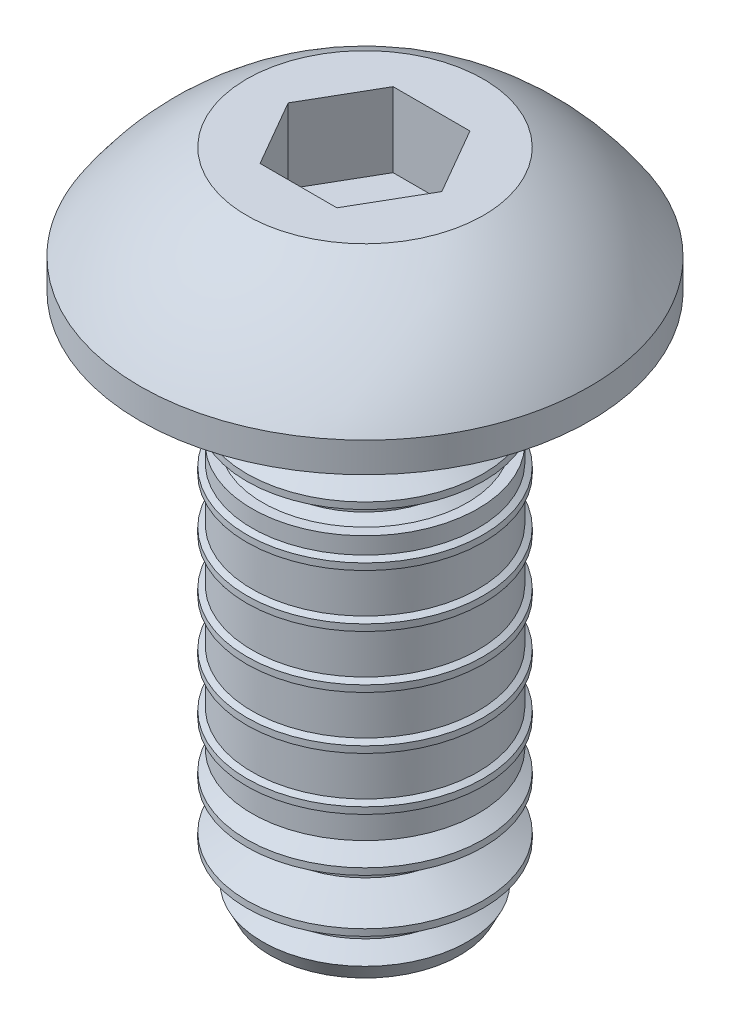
ISO-10303-21;
HEADER;
FILE_DESCRIPTION(('STEP AP214'),'2;1');
FILE_NAME('part.step','',(''),(''),'','','');
FILE_SCHEMA(('AUTOMOTIVE_DESIGN { 1 0 10303 214 1 1 1 1 }'));
ENDSEC;
DATA;
#1=APPLICATION_CONTEXT('core data for automotive mechanical design processes');
#2=APPLICATION_PROTOCOL_DEFINITION('international standard','automotive_design',2000,#1);
#3=PRODUCT_CONTEXT('',#1,'mechanical');
#4=PRODUCT('Part','Part','',(#3));
#5=PRODUCT_RELATED_PRODUCT_CATEGORY('part','',(#4));
#6=PRODUCT_DEFINITION_FORMATION('','',#4);
#7=PRODUCT_DEFINITION_CONTEXT('part definition',#1,'design');
#8=PRODUCT_DEFINITION('design','',#6,#7);
#9=PRODUCT_DEFINITION_SHAPE('','',#8);
#10=(LENGTH_UNIT() NAMED_UNIT(*) SI_UNIT(.MILLI.,.METRE.));
#11=(NAMED_UNIT(*) PLANE_ANGLE_UNIT() SI_UNIT($,.RADIAN.));
#12=(NAMED_UNIT(*) SI_UNIT($,.STERADIAN.) SOLID_ANGLE_UNIT());
#13=UNCERTAINTY_MEASURE_WITH_UNIT(LENGTH_MEASURE(1.E-05),#10,'distance_accuracy_value','');
#14=(GEOMETRIC_REPRESENTATION_CONTEXT(3) GLOBAL_UNCERTAINTY_ASSIGNED_CONTEXT((#13)) GLOBAL_UNIT_ASSIGNED_CONTEXT((#10,
#11,#12)) REPRESENTATION_CONTEXT('',''));
#15=CARTESIAN_POINT('',(0.,0.,0.));
#16=DIRECTION('',(0.,0.,1.));
#17=DIRECTION('',(1.,0.,0.));
#18=AXIS2_PLACEMENT_3D('',#15,#16,#17);
#19=CARTESIAN_POINT('',(1.40662197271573,141.108472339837,0.));
#20=DIRECTION('',(0.,-1.,0.));
#21=DIRECTION('',(0.,0.,-1.));
#22=AXIS2_PLACEMENT_3D('',#19,#20,#21);
#23=PLANE('',#22);
#24=CARTESIAN_POINT('',(0.695421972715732,141.108472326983,0.));
#25=DIRECTION('',(0.,1.,0.));
#26=DIRECTION('',(0.,0.,1.));
#27=AXIS2_PLACEMENT_3D('',#24,#25,#26);
#28=CIRCLE('',#27,1.13792002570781);
#29=CARTESIAN_POINT('',(0.695421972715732,141.108472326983,1.13792002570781));
#30=VERTEX_POINT('',#29);
#31=EDGE_CURVE('E20',#30,#30,#28,.T.);
#32=ORIENTED_EDGE('',*,*,#31,.F.);
#33=EDGE_LOOP('',(#32));
#34=FACE_BOUND('',#33,.T.);
#35=ADVANCED_FACE('F17',(#34),#23,.T.);
#36=CARTESIAN_POINT('',(0.695421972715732,141.297518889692,0.));
#37=DIRECTION('',(0.,1.,0.));
#38=DIRECTION('',(0.,0.,1.));
#39=AXIS2_PLACEMENT_3D('',#36,#37,#38);
#40=CONICAL_SURFACE('',#39,1.23244330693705,0.463647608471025);
#41=ORIENTED_EDGE('',*,*,#31,.T.);
#42=EDGE_LOOP('',(#41));
#43=FACE_BOUND('',#42,.T.);
#44=CARTESIAN_POINT('',(0.695421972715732,141.297518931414,0.));
#45=DIRECTION('',(0.,-1.,0.));
#46=DIRECTION('',(1.,0.,0.));
#47=AXIS2_PLACEMENT_3D('',#44,#45,#46);
#48=CIRCLE('',#47,1.23244329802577);
#49=CARTESIAN_POINT('',(1.92786527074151,141.297518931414,0.));
#50=VERTEX_POINT('',#49);
#51=EDGE_CURVE('E227',#50,#50,#48,.F.);
#52=ORIENTED_EDGE('',*,*,#51,.F.);
#53=EDGE_LOOP('',(#52));
#54=FACE_BOUND('',#53,.T.);
#55=ADVANCED_FACE('F459',(#43,#54),#40,.T.);
#56=CARTESIAN_POINT('',(0.695421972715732,141.297518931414,0.));
#57=DIRECTION('',(0.,-1.,0.));
#58=DIRECTION('',(0.,0.,-1.));
#59=AXIS2_PLACEMENT_3D('',#56,#57,#58);
#60=CONICAL_SURFACE('',#59,1.23244329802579,1.04719754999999);
#61=ORIENTED_EDGE('',*,*,#51,.T.);
#62=EDGE_LOOP('',(#61));
#63=FACE_BOUND('',#62,.T.);
#64=CARTESIAN_POINT('',(0.695421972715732,141.426002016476,0.));
#65=DIRECTION('',(0.,-1.,0.));
#66=DIRECTION('',(0.,0.,-1.));
#67=AXIS2_PLACEMENT_3D('',#64,#65,#66);
#68=CIRCLE('',#67,1.009904);
#69=CARTESIAN_POINT('',(0.695421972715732,141.426002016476,-1.009904));
#70=VERTEX_POINT('',#69);
#71=EDGE_CURVE('E224',#70,#70,#68,.F.);
#72=ORIENTED_EDGE('',*,*,#71,.F.);
#73=EDGE_LOOP('',(#72));
#74=FACE_BOUND('',#73,.T.);
#75=ADVANCED_FACE('F456',(#63,#74),#60,.T.);
#76=CARTESIAN_POINT('',(0.695421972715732,141.465659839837,0.));
#77=DIRECTION('',(0.,-1.,0.));
#78=DIRECTION('',(0.,0.,-1.));
#79=AXIS2_PLACEMENT_3D('',#76,#77,#78);
#80=CYLINDRICAL_SURFACE('',#79,1.009904);
#81=ORIENTED_EDGE('',*,*,#71,.T.);
#82=EDGE_LOOP('',(#81));
#83=FACE_BOUND('',#82,.T.);
#84=CARTESIAN_POINT('',(0.695421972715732,141.505317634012,0.));
#85=DIRECTION('',(0.,1.,0.));
#86=DIRECTION('',(1.,0.,0.));
#87=AXIS2_PLACEMENT_3D('',#84,#85,#86);
#88=CIRCLE('',#87,1.00990401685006);
#89=CARTESIAN_POINT('',(1.70532598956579,141.505317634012,0.));
#90=VERTEX_POINT('',#89);
#91=EDGE_CURVE('E221',#90,#90,#88,.T.);
#92=ORIENTED_EDGE('',*,*,#91,.F.);
#93=EDGE_LOOP('',(#92));
#94=FACE_BOUND('',#93,.T.);
#95=ADVANCED_FACE('F452',(#83,#94),#80,.T.);
#96=CARTESIAN_POINT('',(0.695421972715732,141.743472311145,0.));
#97=DIRECTION('',(0.,1.,0.));
#98=DIRECTION('',(0.,0.,1.));
#99=AXIS2_PLACEMENT_3D('',#96,#97,#98);
#100=CONICAL_SURFACE('',#99,1.42240001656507,1.04719755);
#101=ORIENTED_EDGE('',*,*,#91,.T.);
#102=EDGE_LOOP('',(#101));
#103=FACE_BOUND('',#102,.T.);
#104=CARTESIAN_POINT('',(0.695421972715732,141.743472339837,0.));
#105=DIRECTION('',(0.,-1.,0.));
#106=DIRECTION('',(0.,0.,-1.));
#107=AXIS2_PLACEMENT_3D('',#104,#105,#106);
#108=CIRCLE('',#107,1.4224);
#109=CARTESIAN_POINT('',(0.695421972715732,141.743472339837,-1.4224));
#110=VERTEX_POINT('',#109);
#111=EDGE_CURVE('E218',#110,#110,#108,.F.);
#112=ORIENTED_EDGE('',*,*,#111,.F.);
#113=EDGE_LOOP('',(#112));
#114=FACE_BOUND('',#113,.T.);
#115=ADVANCED_FACE('F448',(#103,#114),#100,.T.);
#116=CARTESIAN_POINT('',(0.695421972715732,144.283472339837,0.));
#117=DIRECTION('',(0.,-1.,0.));
#118=DIRECTION('',(0.,0.,-1.));
#119=AXIS2_PLACEMENT_3D('',#116,#117,#118);
#120=CYLINDRICAL_SURFACE('',#119,1.4224);
#121=ORIENTED_EDGE('',*,*,#111,.T.);
#122=EDGE_LOOP('',(#121));
#123=FACE_BOUND('',#122,.T.);
#124=CARTESIAN_POINT('',(0.695421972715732,141.822847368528,0.));
#125=DIRECTION('',(0.,-1.,0.));
#126=DIRECTION('',(1.,0.,0.));
#127=AXIS2_PLACEMENT_3D('',#124,#125,#126);
#128=CIRCLE('',#127,1.42240001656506);
#129=CARTESIAN_POINT('',(2.11782198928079,141.822847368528,0.));
#130=VERTEX_POINT('',#129);
#131=EDGE_CURVE('E215',#130,#130,#128,.F.);
#132=ORIENTED_EDGE('',*,*,#131,.F.);
#133=EDGE_LOOP('',(#132));
#134=FACE_BOUND('',#133,.T.);
#135=ADVANCED_FACE('F444',(#123,#134),#120,.T.);
#136=CARTESIAN_POINT('',(0.695421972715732,141.822847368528,0.));
#137=DIRECTION('',(0.,-1.,0.));
#138=DIRECTION('',(0.,0.,-1.));
#139=AXIS2_PLACEMENT_3D('',#136,#137,#138);
#140=CONICAL_SURFACE('',#139,1.42240001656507,1.04719755);
#141=ORIENTED_EDGE('',*,*,#131,.T.);
#142=EDGE_LOOP('',(#141));
#143=FACE_BOUND('',#142,.T.);
#144=CARTESIAN_POINT('',(0.695421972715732,142.061002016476,0.));
#145=DIRECTION('',(0.,-1.,0.));
#146=DIRECTION('',(0.,0.,-1.));
#147=AXIS2_PLACEMENT_3D('',#144,#145,#146);
#148=CIRCLE('',#147,1.009904);
#149=CARTESIAN_POINT('',(0.695421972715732,142.061002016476,-1.009904));
#150=VERTEX_POINT('',#149);
#151=EDGE_CURVE('E212',#150,#150,#148,.F.);
#152=ORIENTED_EDGE('',*,*,#151,.F.);
#153=EDGE_LOOP('',(#152));
#154=FACE_BOUND('',#153,.T.);
#155=ADVANCED_FACE('F440',(#143,#154),#140,.T.);
#156=CARTESIAN_POINT('',(0.695421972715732,142.100659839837,0.));
#157=DIRECTION('',(0.,-1.,0.));
#158=DIRECTION('',(0.,0.,-1.));
#159=AXIS2_PLACEMENT_3D('',#156,#157,#158);
#160=CYLINDRICAL_SURFACE('',#159,1.009904);
#161=ORIENTED_EDGE('',*,*,#151,.T.);
#162=EDGE_LOOP('',(#161));
#163=FACE_BOUND('',#162,.T.);
#164=CARTESIAN_POINT('',(0.695421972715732,142.140317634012,0.));
#165=DIRECTION('',(0.,1.,0.));
#166=DIRECTION('',(1.,0.,0.));
#167=AXIS2_PLACEMENT_3D('',#164,#165,#166);
#168=CIRCLE('',#167,1.00990401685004);
#169=CARTESIAN_POINT('',(1.70532598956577,142.140317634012,0.));
#170=VERTEX_POINT('',#169);
#171=EDGE_CURVE('E209',#170,#170,#168,.T.);
#172=ORIENTED_EDGE('',*,*,#171,.F.);
#173=EDGE_LOOP('',(#172));
#174=FACE_BOUND('',#173,.T.);
#175=ADVANCED_FACE('F436',(#163,#174),#160,.T.);
#176=CARTESIAN_POINT('',(0.695421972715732,142.378472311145,0.));
#177=DIRECTION('',(0.,1.,0.));
#178=DIRECTION('',(0.,0.,1.));
#179=AXIS2_PLACEMENT_3D('',#176,#177,#178);
#180=CONICAL_SURFACE('',#179,1.42240001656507,1.04719755);
#181=ORIENTED_EDGE('',*,*,#171,.T.);
#182=EDGE_LOOP('',(#181));
#183=FACE_BOUND('',#182,.T.);
#184=CARTESIAN_POINT('',(0.695421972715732,142.378472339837,0.));
#185=DIRECTION('',(0.,-1.,0.));
#186=DIRECTION('',(0.,0.,-1.));
#187=AXIS2_PLACEMENT_3D('',#184,#185,#186);
#188=CIRCLE('',#187,1.4224);
#189=CARTESIAN_POINT('',(0.695421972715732,142.378472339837,-1.4224));
#190=VERTEX_POINT('',#189);
#191=EDGE_CURVE('E206',#190,#190,#188,.F.);
#192=ORIENTED_EDGE('',*,*,#191,.F.);
#193=EDGE_LOOP('',(#192));
#194=FACE_BOUND('',#193,.T.);
#195=ADVANCED_FACE('F432',(#183,#194),#180,.T.);
#196=CARTESIAN_POINT('',(0.695421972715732,144.283472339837,0.));
#197=DIRECTION('',(0.,-1.,0.));
#198=DIRECTION('',(0.,0.,-1.));
#199=AXIS2_PLACEMENT_3D('',#196,#197,#198);
#200=CYLINDRICAL_SURFACE('',#199,1.4224);
#201=ORIENTED_EDGE('',*,*,#191,.T.);
#202=EDGE_LOOP('',(#201));
#203=FACE_BOUND('',#202,.T.);
#204=CARTESIAN_POINT('',(0.695421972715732,142.457847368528,0.));
#205=DIRECTION('',(0.,-1.,0.));
#206=DIRECTION('',(1.,0.,0.));
#207=AXIS2_PLACEMENT_3D('',#204,#205,#206);
#208=CIRCLE('',#207,1.42240001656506);
#209=CARTESIAN_POINT('',(2.11782198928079,142.457847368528,0.));
#210=VERTEX_POINT('',#209);
#211=EDGE_CURVE('E203',#210,#210,#208,.F.);
#212=ORIENTED_EDGE('',*,*,#211,.F.);
#213=EDGE_LOOP('',(#212));
#214=FACE_BOUND('',#213,.T.);
#215=ADVANCED_FACE('F428',(#203,#214),#200,.T.);
#216=CARTESIAN_POINT('',(0.695421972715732,142.457847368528,0.));
#217=DIRECTION('',(0.,-1.,0.));
#218=DIRECTION('',(0.,0.,-1.));
#219=AXIS2_PLACEMENT_3D('',#216,#217,#218);
#220=CONICAL_SURFACE('',#219,1.42240001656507,1.04719755);
#221=ORIENTED_EDGE('',*,*,#211,.T.);
#222=EDGE_LOOP('',(#221));
#223=FACE_BOUND('',#222,.T.);
#224=CARTESIAN_POINT('',(0.695421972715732,142.696002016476,0.));
#225=DIRECTION('',(0.,-1.,0.));
#226=DIRECTION('',(0.,0.,-1.));
#227=AXIS2_PLACEMENT_3D('',#224,#225,#226);
#228=CIRCLE('',#227,1.009904);
#229=CARTESIAN_POINT('',(0.695421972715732,142.696002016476,-1.009904));
#230=VERTEX_POINT('',#229);
#231=EDGE_CURVE('E200',#230,#230,#228,.F.);
#232=ORIENTED_EDGE('',*,*,#231,.F.);
#233=EDGE_LOOP('',(#232));
#234=FACE_BOUND('',#233,.T.);
#235=ADVANCED_FACE('F424',(#223,#234),#220,.T.);
#236=CARTESIAN_POINT('',(0.695421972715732,142.735659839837,0.));
#237=DIRECTION('',(0.,-1.,0.));
#238=DIRECTION('',(0.,0.,-1.));
#239=AXIS2_PLACEMENT_3D('',#236,#237,#238);
#240=CYLINDRICAL_SURFACE('',#239,1.009904);
#241=ORIENTED_EDGE('',*,*,#231,.T.);
#242=EDGE_LOOP('',(#241));
#243=FACE_BOUND('',#242,.T.);
#244=CARTESIAN_POINT('',(0.695421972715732,142.775317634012,0.));
#245=DIRECTION('',(0.,1.,0.));
#246=DIRECTION('',(1.,0.,0.));
#247=AXIS2_PLACEMENT_3D('',#244,#245,#246);
#248=CIRCLE('',#247,1.00990401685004);
#249=CARTESIAN_POINT('',(1.70532598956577,142.775317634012,0.));
#250=VERTEX_POINT('',#249);
#251=EDGE_CURVE('E197',#250,#250,#248,.T.);
#252=ORIENTED_EDGE('',*,*,#251,.F.);
#253=EDGE_LOOP('',(#252));
#254=FACE_BOUND('',#253,.T.);
#255=ADVANCED_FACE('F420',(#243,#254),#240,.T.);
#256=CARTESIAN_POINT('',(0.695421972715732,142.903487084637,0.));
#257=DIRECTION('',(0.,1.,0.));
#258=DIRECTION('',(0.,0.,1.));
#259=AXIS2_PLACEMENT_3D('',#256,#257,#258);
#260=CONICAL_SURFACE('',#259,1.2319000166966,1.04719755);
#261=ORIENTED_EDGE('',*,*,#251,.T.);
#262=EDGE_LOOP('',(#261));
#263=FACE_BOUND('',#262,.T.);
#264=CARTESIAN_POINT('',(0.695421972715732,142.903487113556,0.));
#265=DIRECTION('',(0.,-1.,0.));
#266=DIRECTION('',(0.,0.,-1.));
#267=AXIS2_PLACEMENT_3D('',#264,#265,#266);
#268=CIRCLE('',#267,1.2319);
#269=CARTESIAN_POINT('',(0.695421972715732,142.903487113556,-1.2319));
#270=VERTEX_POINT('',#269);
#271=EDGE_CURVE('E193',#270,#270,#268,.T.);
#272=ORIENTED_EDGE('',*,*,#271,.T.);
#273=EDGE_LOOP('',(#272));
#274=FACE_BOUND('',#273,.T.);
#275=ADVANCED_FACE('F416',(#263,#274),#260,.T.);
#276=CARTESIAN_POINT('',(0.695421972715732,143.963897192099,0.));
#277=DIRECTION('',(0.,-1.,0.));
#278=DIRECTION('',(0.,0.,-1.));
#279=AXIS2_PLACEMENT_3D('',#276,#277,#278);
#280=CYLINDRICAL_SURFACE('',#279,1.2319);
#281=ORIENTED_EDGE('',*,*,#271,.F.);
#282=EDGE_LOOP('',(#281));
#283=FACE_BOUND('',#282,.T.);
#284=CARTESIAN_POINT('',(0.695421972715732,142.695972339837,0.));
#285=DIRECTION('',(0.,-1.,0.));
#286=DIRECTION('',(0.,0.,-1.));
#287=AXIS2_PLACEMENT_3D('',#284,#285,#286);
#288=CIRCLE('',#287,1.2319);
#289=CARTESIAN_POINT('',(0.695421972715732,142.695972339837,-1.2319));
#290=VERTEX_POINT('',#289);
#291=EDGE_CURVE('E196',#290,#290,#288,.F.);
#292=ORIENTED_EDGE('',*,*,#291,.F.);
#293=EDGE_LOOP('',(#292));
#294=FACE_BOUND('',#293,.T.);
#295=ADVANCED_FACE('F412',(#283,#294),#280,.F.);
#296=CARTESIAN_POINT('',(1.99082197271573,142.695972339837,0.));
#297=DIRECTION('',(0.,-1.,0.));
#298=DIRECTION('',(0.,0.,-1.));
#299=AXIS2_PLACEMENT_3D('',#296,#297,#298);
#300=PLANE('',#299);
#301=ORIENTED_EDGE('',*,*,#291,.T.);
#302=EDGE_LOOP('',(#301));
#303=FACE_BOUND('',#302,.T.);
#304=CARTESIAN_POINT('',(0.695421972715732,142.695972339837,0.));
#305=DIRECTION('',(0.,-1.,0.));
#306=DIRECTION('',(0.,0.,-1.));
#307=AXIS2_PLACEMENT_3D('',#304,#305,#306);
#308=CIRCLE('',#307,1.3589);
#309=CARTESIAN_POINT('',(0.695421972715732,142.695972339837,-1.3589));
#310=VERTEX_POINT('',#309);
#311=EDGE_CURVE('E192',#310,#310,#308,.F.);
#312=ORIENTED_EDGE('',*,*,#311,.F.);
#313=EDGE_LOOP('',(#312));
#314=FACE_BOUND('',#313,.T.);
#315=ADVANCED_FACE('F408',(#303,#314),#300,.T.);
#316=CARTESIAN_POINT('',(0.695421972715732,144.283472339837,0.));
#317=DIRECTION('',(0.,-1.,0.));
#318=DIRECTION('',(0.,0.,-1.));
#319=AXIS2_PLACEMENT_3D('',#316,#317,#318);
#320=CYLINDRICAL_SURFACE('',#319,1.3589);
#321=ORIENTED_EDGE('',*,*,#311,.T.);
#322=EDGE_LOOP('',(#321));
#323=FACE_BOUND('',#322,.T.);
#324=CARTESIAN_POINT('',(0.695421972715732,142.976810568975,0.));
#325=DIRECTION('',(0.,1.,0.));
#326=DIRECTION('',(1.,0.,0.));
#327=AXIS2_PLACEMENT_3D('',#324,#325,#326);
#328=CIRCLE('',#327,1.35890001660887);
#329=CARTESIAN_POINT('',(2.0543219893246,142.976810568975,0.));
#330=VERTEX_POINT('',#329);
#331=EDGE_CURVE('E189',#330,#330,#328,.T.);
#332=ORIENTED_EDGE('',*,*,#331,.F.);
#333=EDGE_LOOP('',(#332));
#334=FACE_BOUND('',#333,.T.);
#335=ADVANCED_FACE('F404',(#323,#334),#320,.T.);
#336=CARTESIAN_POINT('',(0.695421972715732,143.013472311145,0.));
#337=DIRECTION('',(0.,1.,0.));
#338=DIRECTION('',(0.,0.,1.));
#339=AXIS2_PLACEMENT_3D('',#336,#337,#338);
#340=CONICAL_SURFACE('',#339,1.42240001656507,1.04719755);
#341=ORIENTED_EDGE('',*,*,#331,.T.);
#342=EDGE_LOOP('',(#341));
#343=FACE_BOUND('',#342,.T.);
#344=CARTESIAN_POINT('',(0.695421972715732,143.013472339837,0.));
#345=DIRECTION('',(0.,-1.,0.));
#346=DIRECTION('',(0.,0.,-1.));
#347=AXIS2_PLACEMENT_3D('',#344,#345,#346);
#348=CIRCLE('',#347,1.4224);
#349=CARTESIAN_POINT('',(0.695421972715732,143.013472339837,-1.4224));
#350=VERTEX_POINT('',#349);
#351=EDGE_CURVE('E186',#350,#350,#348,.F.);
#352=ORIENTED_EDGE('',*,*,#351,.F.);
#353=EDGE_LOOP('',(#352));
#354=FACE_BOUND('',#353,.T.);
#355=ADVANCED_FACE('F400',(#343,#354),#340,.T.);
#356=CARTESIAN_POINT('',(0.695421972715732,144.283472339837,0.));
#357=DIRECTION('',(0.,-1.,0.));
#358=DIRECTION('',(0.,0.,-1.));
#359=AXIS2_PLACEMENT_3D('',#356,#357,#358);
#360=CYLINDRICAL_SURFACE('',#359,1.4224);
#361=ORIENTED_EDGE('',*,*,#351,.T.);
#362=EDGE_LOOP('',(#361));
#363=FACE_BOUND('',#362,.T.);
#364=CARTESIAN_POINT('',(0.695421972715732,143.092847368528,0.));
#365=DIRECTION('',(0.,-1.,0.));
#366=DIRECTION('',(1.,0.,0.));
#367=AXIS2_PLACEMENT_3D('',#364,#365,#366);
#368=CIRCLE('',#367,1.42240001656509);
#369=CARTESIAN_POINT('',(2.11782198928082,143.092847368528,0.));
#370=VERTEX_POINT('',#369);
#371=EDGE_CURVE('E183',#370,#370,#368,.F.);
#372=ORIENTED_EDGE('',*,*,#371,.F.);
#373=EDGE_LOOP('',(#372));
#374=FACE_BOUND('',#373,.T.);
#375=ADVANCED_FACE('F396',(#363,#374),#360,.T.);
#376=CARTESIAN_POINT('',(0.695421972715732,143.092847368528,0.));
#377=DIRECTION('',(0.,-1.,0.));
#378=DIRECTION('',(0.,0.,-1.));
#379=AXIS2_PLACEMENT_3D('',#376,#377,#378);
#380=CONICAL_SURFACE('',#379,1.42240001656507,1.04719755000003);
#381=ORIENTED_EDGE('',*,*,#371,.T.);
#382=EDGE_LOOP('',(#381));
#383=FACE_BOUND('',#382,.T.);
#384=CARTESIAN_POINT('',(0.695421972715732,143.12950908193,0.));
#385=DIRECTION('',(0.,-1.,0.));
#386=DIRECTION('',(0.,0.,-1.));
#387=AXIS2_PLACEMENT_3D('',#384,#385,#386);
#388=CIRCLE('',#387,1.3589);
#389=CARTESIAN_POINT('',(0.695421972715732,143.12950908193,-1.3589));
#390=VERTEX_POINT('',#389);
#391=EDGE_CURVE('E180',#390,#390,#388,.F.);
#392=ORIENTED_EDGE('',*,*,#391,.F.);
#393=EDGE_LOOP('',(#392));
#394=FACE_BOUND('',#393,.T.);
#395=ADVANCED_FACE('F392',(#383,#394),#380,.T.);
#396=CARTESIAN_POINT('',(0.695421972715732,144.283472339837,0.));
#397=DIRECTION('',(0.,-1.,0.));
#398=DIRECTION('',(0.,0.,-1.));
#399=AXIS2_PLACEMENT_3D('',#396,#397,#398);
#400=CYLINDRICAL_SURFACE('',#399,1.3589);
#401=ORIENTED_EDGE('',*,*,#391,.T.);
#402=EDGE_LOOP('',(#401));
#403=FACE_BOUND('',#402,.T.);
#404=CARTESIAN_POINT('',(0.695421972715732,143.611810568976,0.));
#405=DIRECTION('',(0.,1.,0.));
#406=DIRECTION('',(1.,0.,0.));
#407=AXIS2_PLACEMENT_3D('',#404,#405,#406);
#408=CIRCLE('',#407,1.35890001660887);
#409=CARTESIAN_POINT('',(2.0543219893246,143.611810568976,0.));
#410=VERTEX_POINT('',#409);
#411=EDGE_CURVE('E177',#410,#410,#408,.T.);
#412=ORIENTED_EDGE('',*,*,#411,.F.);
#413=EDGE_LOOP('',(#412));
#414=FACE_BOUND('',#413,.T.);
#415=ADVANCED_FACE('F388',(#403,#414),#400,.T.);
#416=CARTESIAN_POINT('',(0.695421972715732,143.648472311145,0.));
#417=DIRECTION('',(0.,1.,0.));
#418=DIRECTION('',(0.,0.,1.));
#419=AXIS2_PLACEMENT_3D('',#416,#417,#418);
#420=CONICAL_SURFACE('',#419,1.42240001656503,1.04719755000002);
#421=ORIENTED_EDGE('',*,*,#411,.T.);
#422=EDGE_LOOP('',(#421));
#423=FACE_BOUND('',#422,.T.);
#424=CARTESIAN_POINT('',(0.695421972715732,143.648472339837,0.));
#425=DIRECTION('',(0.,-1.,0.));
#426=DIRECTION('',(0.,0.,-1.));
#427=AXIS2_PLACEMENT_3D('',#424,#425,#426);
#428=CIRCLE('',#427,1.4224);
#429=CARTESIAN_POINT('',(0.695421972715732,143.648472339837,-1.4224));
#430=VERTEX_POINT('',#429);
#431=EDGE_CURVE('E174',#430,#430,#428,.F.);
#432=ORIENTED_EDGE('',*,*,#431,.F.);
#433=EDGE_LOOP('',(#432));
#434=FACE_BOUND('',#433,.T.);
#435=ADVANCED_FACE('F384',(#423,#434),#420,.T.);
#436=CARTESIAN_POINT('',(0.695421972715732,144.283472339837,0.));
#437=DIRECTION('',(0.,-1.,0.));
#438=DIRECTION('',(0.,0.,-1.));
#439=AXIS2_PLACEMENT_3D('',#436,#437,#438);
#440=CYLINDRICAL_SURFACE('',#439,1.4224);
#441=ORIENTED_EDGE('',*,*,#431,.T.);
#442=EDGE_LOOP('',(#441));
#443=FACE_BOUND('',#442,.T.);
#444=CARTESIAN_POINT('',(0.695421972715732,143.727847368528,0.));
#445=DIRECTION('',(0.,-1.,0.));
#446=DIRECTION('',(1.,0.,0.));
#447=AXIS2_PLACEMENT_3D('',#444,#445,#446);
#448=CIRCLE('',#447,1.42240001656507);
#449=CARTESIAN_POINT('',(2.11782198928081,143.727847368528,0.));
#450=VERTEX_POINT('',#449);
#451=EDGE_CURVE('E171',#450,#450,#448,.F.);
#452=ORIENTED_EDGE('',*,*,#451,.F.);
#453=EDGE_LOOP('',(#452));
#454=FACE_BOUND('',#453,.T.);
#455=ADVANCED_FACE('F380',(#443,#454),#440,.T.);
#456=CARTESIAN_POINT('',(0.695421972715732,143.727847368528,0.));
#457=DIRECTION('',(0.,-1.,0.));
#458=DIRECTION('',(0.,0.,-1.));
#459=AXIS2_PLACEMENT_3D('',#456,#457,#458);
#460=CONICAL_SURFACE('',#459,1.42240001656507,1.04719755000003);
#461=ORIENTED_EDGE('',*,*,#451,.T.);
#462=EDGE_LOOP('',(#461));
#463=FACE_BOUND('',#462,.T.);
#464=CARTESIAN_POINT('',(0.695421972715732,143.76450908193,0.));
#465=DIRECTION('',(0.,-1.,0.));
#466=DIRECTION('',(0.,0.,-1.));
#467=AXIS2_PLACEMENT_3D('',#464,#465,#466);
#468=CIRCLE('',#467,1.3589);
#469=CARTESIAN_POINT('',(0.695421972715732,143.76450908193,-1.3589));
#470=VERTEX_POINT('',#469);
#471=EDGE_CURVE('E168',#470,#470,#468,.F.);
#472=ORIENTED_EDGE('',*,*,#471,.F.);
#473=EDGE_LOOP('',(#472));
#474=FACE_BOUND('',#473,.T.);
#475=ADVANCED_FACE('F376',(#463,#474),#460,.T.);
#476=CARTESIAN_POINT('',(0.695421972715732,144.283472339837,0.));
#477=DIRECTION('',(0.,-1.,0.));
#478=DIRECTION('',(0.,0.,-1.));
#479=AXIS2_PLACEMENT_3D('',#476,#477,#478);
#480=CYLINDRICAL_SURFACE('',#479,1.3589);
#481=ORIENTED_EDGE('',*,*,#471,.T.);
#482=EDGE_LOOP('',(#481));
#483=FACE_BOUND('',#482,.T.);
#484=CARTESIAN_POINT('',(0.695421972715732,144.246810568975,0.));
#485=DIRECTION('',(0.,1.,0.));
#486=DIRECTION('',(1.,0.,0.));
#487=AXIS2_PLACEMENT_3D('',#484,#485,#486);
#488=CIRCLE('',#487,1.35890001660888);
#489=CARTESIAN_POINT('',(2.05432198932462,144.246810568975,0.));
#490=VERTEX_POINT('',#489);
#491=EDGE_CURVE('E165',#490,#490,#488,.T.);
#492=ORIENTED_EDGE('',*,*,#491,.F.);
#493=EDGE_LOOP('',(#492));
#494=FACE_BOUND('',#493,.T.);
#495=ADVANCED_FACE('F372',(#483,#494),#480,.T.);
#496=CARTESIAN_POINT('',(0.695421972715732,144.283472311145,0.));
#497=DIRECTION('',(0.,1.,0.));
#498=DIRECTION('',(0.,0.,1.));
#499=AXIS2_PLACEMENT_3D('',#496,#497,#498);
#500=CONICAL_SURFACE('',#499,1.42240001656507,1.04719755);
#501=ORIENTED_EDGE('',*,*,#491,.T.);
#502=EDGE_LOOP('',(#501));
#503=FACE_BOUND('',#502,.T.);
#504=CARTESIAN_POINT('',(0.695421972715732,144.283472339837,0.));
#505=DIRECTION('',(0.,-1.,0.));
#506=DIRECTION('',(0.,0.,-1.));
#507=AXIS2_PLACEMENT_3D('',#504,#505,#506);
#508=CIRCLE('',#507,1.4224);
#509=CARTESIAN_POINT('',(0.695421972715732,144.283472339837,-1.4224));
#510=VERTEX_POINT('',#509);
#511=EDGE_CURVE('E162',#510,#510,#508,.F.);
#512=ORIENTED_EDGE('',*,*,#511,.F.);
#513=EDGE_LOOP('',(#512));
#514=FACE_BOUND('',#513,.T.);
#515=ADVANCED_FACE('F368',(#503,#514),#500,.T.);
#516=CARTESIAN_POINT('',(0.695421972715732,144.283472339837,0.));
#517=DIRECTION('',(0.,-1.,0.));
#518=DIRECTION('',(0.,0.,-1.));
#519=AXIS2_PLACEMENT_3D('',#516,#517,#518);
#520=CYLINDRICAL_SURFACE('',#519,1.4224);
#521=ORIENTED_EDGE('',*,*,#511,.T.);
#522=EDGE_LOOP('',(#521));
#523=FACE_BOUND('',#522,.T.);
#524=CARTESIAN_POINT('',(0.695421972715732,144.362847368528,0.));
#525=DIRECTION('',(0.,-1.,0.));
#526=DIRECTION('',(1.,0.,0.));
#527=AXIS2_PLACEMENT_3D('',#524,#525,#526);
#528=CIRCLE('',#527,1.4224000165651);
#529=CARTESIAN_POINT('',(2.11782198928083,144.362847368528,0.));
#530=VERTEX_POINT('',#529);
#531=EDGE_CURVE('E159',#530,#530,#528,.F.);
#532=ORIENTED_EDGE('',*,*,#531,.F.);
#533=EDGE_LOOP('',(#532));
#534=FACE_BOUND('',#533,.T.);
#535=ADVANCED_FACE('F364',(#523,#534),#520,.T.);
#536=CARTESIAN_POINT('',(0.695421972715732,144.362847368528,0.));
#537=DIRECTION('',(0.,-1.,0.));
#538=DIRECTION('',(0.,0.,-1.));
#539=AXIS2_PLACEMENT_3D('',#536,#537,#538);
#540=CONICAL_SURFACE('',#539,1.42240001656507,1.04719755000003);
#541=ORIENTED_EDGE('',*,*,#531,.T.);
#542=EDGE_LOOP('',(#541));
#543=FACE_BOUND('',#542,.T.);
#544=CARTESIAN_POINT('',(0.695421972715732,144.39950908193,0.));
#545=DIRECTION('',(0.,-1.,0.));
#546=DIRECTION('',(0.,0.,-1.));
#547=AXIS2_PLACEMENT_3D('',#544,#545,#546);
#548=CIRCLE('',#547,1.3589);
#549=CARTESIAN_POINT('',(0.695421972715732,144.39950908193,-1.3589));
#550=VERTEX_POINT('',#549);
#551=EDGE_CURVE('E156',#550,#550,#548,.F.);
#552=ORIENTED_EDGE('',*,*,#551,.F.);
#553=EDGE_LOOP('',(#552));
#554=FACE_BOUND('',#553,.T.);
#555=ADVANCED_FACE('F360',(#543,#554),#540,.T.);
#556=CARTESIAN_POINT('',(0.695421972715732,144.283472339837,0.));
#557=DIRECTION('',(0.,-1.,0.));
#558=DIRECTION('',(0.,0.,-1.));
#559=AXIS2_PLACEMENT_3D('',#556,#557,#558);
#560=CYLINDRICAL_SURFACE('',#559,1.3589);
#561=ORIENTED_EDGE('',*,*,#551,.T.);
#562=EDGE_LOOP('',(#561));
#563=FACE_BOUND('',#562,.T.);
#564=CARTESIAN_POINT('',(0.695421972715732,144.881810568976,0.));
#565=DIRECTION('',(0.,1.,0.));
#566=DIRECTION('',(1.,0.,0.));
#567=AXIS2_PLACEMENT_3D('',#564,#565,#566);
#568=CIRCLE('',#567,1.35890001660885);
#569=CARTESIAN_POINT('',(2.05432198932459,144.881810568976,0.));
#570=VERTEX_POINT('',#569);
#571=EDGE_CURVE('E153',#570,#570,#568,.T.);
#572=ORIENTED_EDGE('',*,*,#571,.F.);
#573=EDGE_LOOP('',(#572));
#574=FACE_BOUND('',#573,.T.);
#575=ADVANCED_FACE('F356',(#563,#574),#560,.T.);
#576=CARTESIAN_POINT('',(0.695421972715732,144.918472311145,0.));
#577=DIRECTION('',(0.,1.,0.));
#578=DIRECTION('',(0.,0.,1.));
#579=AXIS2_PLACEMENT_3D('',#576,#577,#578);
#580=CONICAL_SURFACE('',#579,1.42240001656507,1.04719755);
#581=ORIENTED_EDGE('',*,*,#571,.T.);
#582=EDGE_LOOP('',(#581));
#583=FACE_BOUND('',#582,.T.);
#584=CARTESIAN_POINT('',(0.695421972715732,144.918472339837,0.));
#585=DIRECTION('',(0.,-1.,0.));
#586=DIRECTION('',(0.,0.,-1.));
#587=AXIS2_PLACEMENT_3D('',#584,#585,#586);
#588=CIRCLE('',#587,1.4224);
#589=CARTESIAN_POINT('',(0.695421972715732,144.918472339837,-1.4224));
#590=VERTEX_POINT('',#589);
#591=EDGE_CURVE('E150',#590,#590,#588,.F.);
#592=ORIENTED_EDGE('',*,*,#591,.F.);
#593=EDGE_LOOP('',(#592));
#594=FACE_BOUND('',#593,.T.);
#595=ADVANCED_FACE('F352',(#583,#594),#580,.T.);
#596=CARTESIAN_POINT('',(0.695421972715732,144.283472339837,0.));
#597=DIRECTION('',(0.,-1.,0.));
#598=DIRECTION('',(0.,0.,-1.));
#599=AXIS2_PLACEMENT_3D('',#596,#597,#598);
#600=CYLINDRICAL_SURFACE('',#599,1.4224);
#601=ORIENTED_EDGE('',*,*,#591,.T.);
#602=EDGE_LOOP('',(#601));
#603=FACE_BOUND('',#602,.T.);
#604=CARTESIAN_POINT('',(0.695421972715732,144.997847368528,0.));
#605=DIRECTION('',(0.,-1.,0.));
#606=DIRECTION('',(1.,0.,0.));
#607=AXIS2_PLACEMENT_3D('',#604,#605,#606);
#608=CIRCLE('',#607,1.42240001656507);
#609=CARTESIAN_POINT('',(2.11782198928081,144.997847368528,0.));
#610=VERTEX_POINT('',#609);
#611=EDGE_CURVE('E147',#610,#610,#608,.F.);
#612=ORIENTED_EDGE('',*,*,#611,.F.);
#613=EDGE_LOOP('',(#612));
#614=FACE_BOUND('',#613,.T.);
#615=ADVANCED_FACE('F348',(#603,#614),#600,.T.);
#616=CARTESIAN_POINT('',(0.695421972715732,144.997847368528,0.));
#617=DIRECTION('',(0.,-1.,0.));
#618=DIRECTION('',(0.,0.,-1.));
#619=AXIS2_PLACEMENT_3D('',#616,#617,#618);
#620=CONICAL_SURFACE('',#619,1.42240001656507,1.04719755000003);
#621=ORIENTED_EDGE('',*,*,#611,.T.);
#622=EDGE_LOOP('',(#621));
#623=FACE_BOUND('',#622,.T.);
#624=CARTESIAN_POINT('',(0.695421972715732,145.03450908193,0.));
#625=DIRECTION('',(0.,-1.,0.));
#626=DIRECTION('',(0.,0.,-1.));
#627=AXIS2_PLACEMENT_3D('',#624,#625,#626);
#628=CIRCLE('',#627,1.3589);
#629=CARTESIAN_POINT('',(0.695421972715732,145.03450908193,-1.3589));
#630=VERTEX_POINT('',#629);
#631=EDGE_CURVE('E144',#630,#630,#628,.F.);
#632=ORIENTED_EDGE('',*,*,#631,.F.);
#633=EDGE_LOOP('',(#632));
#634=FACE_BOUND('',#633,.T.);
#635=ADVANCED_FACE('F344',(#623,#634),#620,.T.);
#636=CARTESIAN_POINT('',(0.695421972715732,144.283472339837,0.));
#637=DIRECTION('',(0.,-1.,0.));
#638=DIRECTION('',(0.,0.,-1.));
#639=AXIS2_PLACEMENT_3D('',#636,#637,#638);
#640=CYLINDRICAL_SURFACE('',#639,1.3589);
#641=ORIENTED_EDGE('',*,*,#631,.T.);
#642=EDGE_LOOP('',(#641));
#643=FACE_BOUND('',#642,.T.);
#644=CARTESIAN_POINT('',(0.695421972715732,145.516810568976,0.));
#645=DIRECTION('',(0.,1.,0.));
#646=DIRECTION('',(1.,0.,0.));
#647=AXIS2_PLACEMENT_3D('',#644,#645,#646);
#648=CIRCLE('',#647,1.35890001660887);
#649=CARTESIAN_POINT('',(2.0543219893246,145.516810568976,0.));
#650=VERTEX_POINT('',#649);
#651=EDGE_CURVE('E141',#650,#650,#648,.T.);
#652=ORIENTED_EDGE('',*,*,#651,.F.);
#653=EDGE_LOOP('',(#652));
#654=FACE_BOUND('',#653,.T.);
#655=ADVANCED_FACE('F340',(#643,#654),#640,.T.);
#656=CARTESIAN_POINT('',(0.695421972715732,145.553472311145,0.));
#657=DIRECTION('',(0.,1.,0.));
#658=DIRECTION('',(0.,0.,1.));
#659=AXIS2_PLACEMENT_3D('',#656,#657,#658);
#660=CONICAL_SURFACE('',#659,1.42240001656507,1.04719755);
#661=ORIENTED_EDGE('',*,*,#651,.T.);
#662=EDGE_LOOP('',(#661));
#663=FACE_BOUND('',#662,.T.);
#664=CARTESIAN_POINT('',(0.695421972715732,145.553472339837,0.));
#665=DIRECTION('',(0.,-1.,0.));
#666=DIRECTION('',(0.,0.,-1.));
#667=AXIS2_PLACEMENT_3D('',#664,#665,#666);
#668=CIRCLE('',#667,1.4224);
#669=CARTESIAN_POINT('',(0.695421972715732,145.553472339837,-1.4224));
#670=VERTEX_POINT('',#669);
#671=EDGE_CURVE('E138',#670,#670,#668,.F.);
#672=ORIENTED_EDGE('',*,*,#671,.F.);
#673=EDGE_LOOP('',(#672));
#674=FACE_BOUND('',#673,.T.);
#675=ADVANCED_FACE('F336',(#663,#674),#660,.T.);
#676=CARTESIAN_POINT('',(0.695421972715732,144.283472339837,0.));
#677=DIRECTION('',(0.,-1.,0.));
#678=DIRECTION('',(0.,0.,-1.));
#679=AXIS2_PLACEMENT_3D('',#676,#677,#678);
#680=CYLINDRICAL_SURFACE('',#679,1.4224);
#681=ORIENTED_EDGE('',*,*,#671,.T.);
#682=EDGE_LOOP('',(#681));
#683=FACE_BOUND('',#682,.T.);
#684=CARTESIAN_POINT('',(0.695421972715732,145.632847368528,0.));
#685=DIRECTION('',(0.,-1.,0.));
#686=DIRECTION('',(1.,0.,0.));
#687=AXIS2_PLACEMENT_3D('',#684,#685,#686);
#688=CIRCLE('',#687,1.42240001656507);
#689=CARTESIAN_POINT('',(2.11782198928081,145.632847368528,0.));
#690=VERTEX_POINT('',#689);
#691=EDGE_CURVE('E135',#690,#690,#688,.F.);
#692=ORIENTED_EDGE('',*,*,#691,.F.);
#693=EDGE_LOOP('',(#692));
#694=FACE_BOUND('',#693,.T.);
#695=ADVANCED_FACE('F332',(#683,#694),#680,.T.);
#696=CARTESIAN_POINT('',(0.695421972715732,145.632847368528,0.));
#697=DIRECTION('',(0.,-1.,0.));
#698=DIRECTION('',(0.,0.,-1.));
#699=AXIS2_PLACEMENT_3D('',#696,#697,#698);
#700=CONICAL_SURFACE('',#699,1.42240001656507,1.04719755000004);
#701=ORIENTED_EDGE('',*,*,#691,.T.);
#702=EDGE_LOOP('',(#701));
#703=FACE_BOUND('',#702,.T.);
#704=CARTESIAN_POINT('',(0.695421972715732,145.66950908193,0.));
#705=DIRECTION('',(0.,-1.,0.));
#706=DIRECTION('',(0.,0.,-1.));
#707=AXIS2_PLACEMENT_3D('',#704,#705,#706);
#708=CIRCLE('',#707,1.3589);
#709=CARTESIAN_POINT('',(0.695421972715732,145.66950908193,-1.3589));
#710=VERTEX_POINT('',#709);
#711=EDGE_CURVE('E131',#710,#710,#708,.F.);
#712=ORIENTED_EDGE('',*,*,#711,.F.);
#713=EDGE_LOOP('',(#712));
#714=FACE_BOUND('',#713,.T.);
#715=ADVANCED_FACE('F328',(#703,#714),#700,.T.);
#716=CARTESIAN_POINT('',(0.695421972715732,144.283472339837,0.));
#717=DIRECTION('',(0.,-1.,0.));
#718=DIRECTION('',(0.,0.,-1.));
#719=AXIS2_PLACEMENT_3D('',#716,#717,#718);
#720=CYLINDRICAL_SURFACE('',#719,1.3589);
#721=ORIENTED_EDGE('',*,*,#711,.T.);
#722=EDGE_LOOP('',(#721));
#723=FACE_BOUND('',#722,.T.);
#724=CARTESIAN_POINT('',(0.695421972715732,145.870972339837,0.));
#725=DIRECTION('',(0.,-1.,0.));
#726=DIRECTION('',(0.,0.,-1.));
#727=AXIS2_PLACEMENT_3D('',#724,#725,#726);
#728=CIRCLE('',#727,1.3589);
#729=CARTESIAN_POINT('',(0.695421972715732,145.870972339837,-1.3589));
#730=VERTEX_POINT('',#729);
#731=EDGE_CURVE('E134',#730,#730,#728,.F.);
#732=ORIENTED_EDGE('',*,*,#731,.F.);
#733=EDGE_LOOP('',(#732));
#734=FACE_BOUND('',#733,.T.);
#735=ADVANCED_FACE('F324',(#723,#734),#720,.T.);
#736=CARTESIAN_POINT('',(1.99082197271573,145.870972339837,0.));
#737=DIRECTION('',(0.,1.,0.));
#738=DIRECTION('',(0.,0.,1.));
#739=AXIS2_PLACEMENT_3D('',#736,#737,#738);
#740=PLANE('',#739);
#741=CARTESIAN_POINT('',(0.695421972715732,145.870972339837,0.));
#742=DIRECTION('',(0.,-1.,0.));
#743=DIRECTION('',(0.,0.,-1.));
#744=AXIS2_PLACEMENT_3D('',#741,#742,#743);
#745=CIRCLE('',#744,1.2319);
#746=CARTESIAN_POINT('',(0.695421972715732,145.870972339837,-1.2319));
#747=VERTEX_POINT('',#746);
#748=EDGE_CURVE('E130',#747,#747,#745,.T.);
#749=ORIENTED_EDGE('',*,*,#748,.T.);
#750=EDGE_LOOP('',(#749));
#751=FACE_BOUND('',#750,.T.);
#752=ORIENTED_EDGE('',*,*,#731,.T.);
#753=EDGE_LOOP('',(#752));
#754=FACE_BOUND('',#753,.T.);
#755=ADVANCED_FACE('F320',(#751,#754),#740,.T.);
#756=CARTESIAN_POINT('',(0.695421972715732,145.849188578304,0.));
#757=DIRECTION('',(0.,-1.,0.));
#758=DIRECTION('',(0.,0.,-1.));
#759=AXIS2_PLACEMENT_3D('',#756,#757,#758);
#760=CYLINDRICAL_SURFACE('',#759,1.2319);
#761=ORIENTED_EDGE('',*,*,#748,.F.);
#762=EDGE_LOOP('',(#761));
#763=FACE_BOUND('',#762,.T.);
#764=CARTESIAN_POINT('',(0.695421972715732,145.742832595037,0.));
#765=DIRECTION('',(0.,-1.,0.));
#766=DIRECTION('',(1.,0.,0.));
#767=AXIS2_PLACEMENT_3D('',#764,#765,#766);
#768=CIRCLE('',#767,1.23190001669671);
#769=CARTESIAN_POINT('',(1.92732198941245,145.742832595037,0.));
#770=VERTEX_POINT('',#769);
#771=EDGE_CURVE('E127',#770,#770,#768,.F.);
#772=ORIENTED_EDGE('',*,*,#771,.F.);
#773=EDGE_LOOP('',(#772));
#774=FACE_BOUND('',#773,.T.);
#775=ADVANCED_FACE('F316',(#763,#774),#760,.F.);
#776=CARTESIAN_POINT('',(0.695421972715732,145.742832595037,0.));
#777=DIRECTION('',(0.,-1.,0.));
#778=DIRECTION('',(0.,0.,-1.));
#779=AXIS2_PLACEMENT_3D('',#776,#777,#778);
#780=CONICAL_SURFACE('',#779,1.23190001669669,1.04719755);
#781=ORIENTED_EDGE('',*,*,#771,.T.);
#782=EDGE_LOOP('',(#781));
#783=FACE_BOUND('',#782,.T.);
#784=CARTESIAN_POINT('',(0.695421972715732,145.871002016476,0.));
#785=DIRECTION('',(0.,-1.,0.));
#786=DIRECTION('',(0.,0.,-1.));
#787=AXIS2_PLACEMENT_3D('',#784,#785,#786);
#788=CIRCLE('',#787,1.009904);
#789=CARTESIAN_POINT('',(0.695421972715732,145.871002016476,-1.009904));
#790=VERTEX_POINT('',#789);
#791=EDGE_CURVE('E124',#790,#790,#788,.F.);
#792=ORIENTED_EDGE('',*,*,#791,.F.);
#793=EDGE_LOOP('',(#792));
#794=FACE_BOUND('',#793,.T.);
#795=ADVANCED_FACE('F312',(#783,#794),#780,.T.);
#796=CARTESIAN_POINT('',(0.695421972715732,145.910659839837,0.));
#797=DIRECTION('',(0.,-1.,0.));
#798=DIRECTION('',(0.,0.,-1.));
#799=AXIS2_PLACEMENT_3D('',#796,#797,#798);
#800=CYLINDRICAL_SURFACE('',#799,1.009904);
#801=ORIENTED_EDGE('',*,*,#791,.T.);
#802=EDGE_LOOP('',(#801));
#803=FACE_BOUND('',#802,.T.);
#804=CARTESIAN_POINT('',(0.695421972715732,145.950317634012,0.));
#805=DIRECTION('',(0.,1.,0.));
#806=DIRECTION('',(1.,0.,0.));
#807=AXIS2_PLACEMENT_3D('',#804,#805,#806);
#808=CIRCLE('',#807,1.00990401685);
#809=CARTESIAN_POINT('',(1.70532598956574,145.950317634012,0.));
#810=VERTEX_POINT('',#809);
#811=EDGE_CURVE('E121',#810,#810,#808,.T.);
#812=ORIENTED_EDGE('',*,*,#811,.F.);
#813=EDGE_LOOP('',(#812));
#814=FACE_BOUND('',#813,.T.);
#815=ADVANCED_FACE('F308',(#803,#814),#800,.T.);
#816=CARTESIAN_POINT('',(0.695421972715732,146.188472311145,0.));
#817=DIRECTION('',(0.,1.,0.));
#818=DIRECTION('',(0.,0.,1.));
#819=AXIS2_PLACEMENT_3D('',#816,#817,#818);
#820=CONICAL_SURFACE('',#819,1.42240001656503,1.04719755);
#821=ORIENTED_EDGE('',*,*,#811,.T.);
#822=EDGE_LOOP('',(#821));
#823=FACE_BOUND('',#822,.T.);
#824=CARTESIAN_POINT('',(0.695421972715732,146.188472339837,0.));
#825=DIRECTION('',(0.,-1.,0.));
#826=DIRECTION('',(0.,0.,-1.));
#827=AXIS2_PLACEMENT_3D('',#824,#825,#826);
#828=CIRCLE('',#827,1.4224);
#829=CARTESIAN_POINT('',(0.695421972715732,146.188472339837,-1.4224));
#830=VERTEX_POINT('',#829);
#831=EDGE_CURVE('E118',#830,#830,#828,.F.);
#832=ORIENTED_EDGE('',*,*,#831,.F.);
#833=EDGE_LOOP('',(#832));
#834=FACE_BOUND('',#833,.T.);
#835=ADVANCED_FACE('F304',(#823,#834),#820,.T.);
#836=CARTESIAN_POINT('',(0.695421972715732,144.283472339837,0.));
#837=DIRECTION('',(0.,-1.,0.));
#838=DIRECTION('',(0.,0.,-1.));
#839=AXIS2_PLACEMENT_3D('',#836,#837,#838);
#840=CYLINDRICAL_SURFACE('',#839,1.4224);
#841=ORIENTED_EDGE('',*,*,#831,.T.);
#842=EDGE_LOOP('',(#841));
#843=FACE_BOUND('',#842,.T.);
#844=CARTESIAN_POINT('',(0.695421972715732,146.267847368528,0.));
#845=DIRECTION('',(0.,-1.,0.));
#846=DIRECTION('',(1.,0.,0.));
#847=AXIS2_PLACEMENT_3D('',#844,#845,#846);
#848=CIRCLE('',#847,1.42240001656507);
#849=CARTESIAN_POINT('',(2.11782198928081,146.267847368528,0.));
#850=VERTEX_POINT('',#849);
#851=EDGE_CURVE('E115',#850,#850,#848,.F.);
#852=ORIENTED_EDGE('',*,*,#851,.F.);
#853=EDGE_LOOP('',(#852));
#854=FACE_BOUND('',#853,.T.);
#855=ADVANCED_FACE('F300',(#843,#854),#840,.T.);
#856=CARTESIAN_POINT('',(0.695421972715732,146.267847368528,0.));
#857=DIRECTION('',(0.,-1.,0.));
#858=DIRECTION('',(0.,0.,-1.));
#859=AXIS2_PLACEMENT_3D('',#856,#857,#858);
#860=CONICAL_SURFACE('',#859,1.42240001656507,1.04719755);
#861=ORIENTED_EDGE('',*,*,#851,.T.);
#862=EDGE_LOOP('',(#861));
#863=FACE_BOUND('',#862,.T.);
#864=CARTESIAN_POINT('',(0.695421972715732,146.506002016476,0.));
#865=DIRECTION('',(0.,-1.,0.));
#866=DIRECTION('',(0.,0.,-1.));
#867=AXIS2_PLACEMENT_3D('',#864,#865,#866);
#868=CIRCLE('',#867,1.009904);
#869=CARTESIAN_POINT('',(0.695421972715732,146.506002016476,-1.009904));
#870=VERTEX_POINT('',#869);
#871=EDGE_CURVE('E112',#870,#870,#868,.F.);
#872=ORIENTED_EDGE('',*,*,#871,.F.);
#873=EDGE_LOOP('',(#872));
#874=FACE_BOUND('',#873,.T.);
#875=ADVANCED_FACE('F296',(#863,#874),#860,.T.);
#876=CARTESIAN_POINT('',(0.695421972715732,146.545659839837,0.));
#877=DIRECTION('',(0.,-1.,0.));
#878=DIRECTION('',(0.,0.,-1.));
#879=AXIS2_PLACEMENT_3D('',#876,#877,#878);
#880=CYLINDRICAL_SURFACE('',#879,1.009904);
#881=ORIENTED_EDGE('',*,*,#871,.T.);
#882=EDGE_LOOP('',(#881));
#883=FACE_BOUND('',#882,.T.);
#884=CARTESIAN_POINT('',(0.695421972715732,146.585317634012,0.));
#885=DIRECTION('',(0.,1.,0.));
#886=DIRECTION('',(1.,0.,0.));
#887=AXIS2_PLACEMENT_3D('',#884,#885,#886);
#888=CIRCLE('',#887,1.00990401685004);
#889=CARTESIAN_POINT('',(1.70532598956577,146.585317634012,0.));
#890=VERTEX_POINT('',#889);
#891=EDGE_CURVE('E109',#890,#890,#888,.T.);
#892=ORIENTED_EDGE('',*,*,#891,.F.);
#893=EDGE_LOOP('',(#892));
#894=FACE_BOUND('',#893,.T.);
#895=ADVANCED_FACE('F292',(#883,#894),#880,.T.);
#896=CARTESIAN_POINT('',(0.695421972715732,146.823472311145,0.));
#897=DIRECTION('',(0.,1.,0.));
#898=DIRECTION('',(0.,0.,1.));
#899=AXIS2_PLACEMENT_3D('',#896,#897,#898);
#900=CONICAL_SURFACE('',#899,1.42240001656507,1.04719755);
#901=ORIENTED_EDGE('',*,*,#891,.T.);
#902=EDGE_LOOP('',(#901));
#903=FACE_BOUND('',#902,.T.);
#904=CARTESIAN_POINT('',(0.695421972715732,146.823472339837,0.));
#905=DIRECTION('',(0.,-1.,0.));
#906=DIRECTION('',(0.,0.,-1.));
#907=AXIS2_PLACEMENT_3D('',#904,#905,#906);
#908=CIRCLE('',#907,1.4224);
#909=CARTESIAN_POINT('',(0.695421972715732,146.823472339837,-1.4224));
#910=VERTEX_POINT('',#909);
#911=EDGE_CURVE('E106',#910,#910,#908,.F.);
#912=ORIENTED_EDGE('',*,*,#911,.F.);
#913=EDGE_LOOP('',(#912));
#914=FACE_BOUND('',#913,.T.);
#915=ADVANCED_FACE('F288',(#903,#914),#900,.T.);
#916=CARTESIAN_POINT('',(0.695421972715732,144.283472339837,0.));
#917=DIRECTION('',(0.,-1.,0.));
#918=DIRECTION('',(0.,0.,-1.));
#919=AXIS2_PLACEMENT_3D('',#916,#917,#918);
#920=CYLINDRICAL_SURFACE('',#919,1.4224);
#921=ORIENTED_EDGE('',*,*,#911,.T.);
#922=EDGE_LOOP('',(#921));
#923=FACE_BOUND('',#922,.T.);
#924=CARTESIAN_POINT('',(0.695421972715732,146.902847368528,0.));
#925=DIRECTION('',(0.,-1.,0.));
#926=DIRECTION('',(1.,0.,0.));
#927=AXIS2_PLACEMENT_3D('',#924,#925,#926);
#928=CIRCLE('',#927,1.42240001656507);
#929=CARTESIAN_POINT('',(2.11782198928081,146.902847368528,0.));
#930=VERTEX_POINT('',#929);
#931=EDGE_CURVE('E103',#930,#930,#928,.F.);
#932=ORIENTED_EDGE('',*,*,#931,.F.);
#933=EDGE_LOOP('',(#932));
#934=FACE_BOUND('',#933,.T.);
#935=ADVANCED_FACE('F284',(#923,#934),#920,.T.);
#936=CARTESIAN_POINT('',(0.695421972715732,146.902847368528,0.));
#937=DIRECTION('',(0.,-1.,0.));
#938=DIRECTION('',(0.,0.,-1.));
#939=AXIS2_PLACEMENT_3D('',#936,#937,#938);
#940=CONICAL_SURFACE('',#939,1.42240001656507,1.04719755);
#941=ORIENTED_EDGE('',*,*,#931,.T.);
#942=EDGE_LOOP('',(#941));
#943=FACE_BOUND('',#942,.T.);
#944=CARTESIAN_POINT('',(0.695421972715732,147.141002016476,0.));
#945=DIRECTION('',(0.,-1.,0.));
#946=DIRECTION('',(0.,0.,-1.));
#947=AXIS2_PLACEMENT_3D('',#944,#945,#946);
#948=CIRCLE('',#947,1.009904);
#949=CARTESIAN_POINT('',(0.695421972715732,147.141002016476,-1.009904));
#950=VERTEX_POINT('',#949);
#951=EDGE_CURVE('E100',#950,#950,#948,.F.);
#952=ORIENTED_EDGE('',*,*,#951,.F.);
#953=EDGE_LOOP('',(#952));
#954=FACE_BOUND('',#953,.T.);
#955=ADVANCED_FACE('F280',(#943,#954),#940,.T.);
#956=CARTESIAN_POINT('',(0.695421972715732,147.180659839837,0.));
#957=DIRECTION('',(0.,-1.,0.));
#958=DIRECTION('',(0.,0.,-1.));
#959=AXIS2_PLACEMENT_3D('',#956,#957,#958);
#960=CYLINDRICAL_SURFACE('',#959,1.009904);
#961=ORIENTED_EDGE('',*,*,#951,.T.);
#962=EDGE_LOOP('',(#961));
#963=FACE_BOUND('',#962,.T.);
#964=CARTESIAN_POINT('',(0.695421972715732,147.220317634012,0.));
#965=DIRECTION('',(0.,1.,0.));
#966=DIRECTION('',(1.,0.,0.));
#967=AXIS2_PLACEMENT_3D('',#964,#965,#966);
#968=CIRCLE('',#967,1.00990401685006);
#969=CARTESIAN_POINT('',(1.70532598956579,147.220317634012,0.));
#970=VERTEX_POINT('',#969);
#971=EDGE_CURVE('E97',#970,#970,#968,.T.);
#972=ORIENTED_EDGE('',*,*,#971,.F.);
#973=EDGE_LOOP('',(#972));
#974=FACE_BOUND('',#973,.T.);
#975=ADVANCED_FACE('F276',(#963,#974),#960,.T.);
#976=CARTESIAN_POINT('',(0.695421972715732,147.458472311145,0.));
#977=DIRECTION('',(0.,1.,0.));
#978=DIRECTION('',(0.,0.,1.));
#979=AXIS2_PLACEMENT_3D('',#976,#977,#978);
#980=CONICAL_SURFACE('',#979,1.42240001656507,1.04719755);
#981=ORIENTED_EDGE('',*,*,#971,.T.);
#982=EDGE_LOOP('',(#981));
#983=FACE_BOUND('',#982,.T.);
#984=CARTESIAN_POINT('',(0.695421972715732,147.458472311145,0.));
#985=DIRECTION('',(0.,1.,0.));
#986=DIRECTION('',(0.,0.,1.));
#987=AXIS2_PLACEMENT_3D('',#984,#985,#986);
#988=CIRCLE('',#987,1.42240001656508);
#989=CARTESIAN_POINT('',(0.695421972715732,147.458472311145,1.42240001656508));
#990=VERTEX_POINT('',#989);
#991=EDGE_CURVE('E86',#990,#990,#988,.T.);
#992=ORIENTED_EDGE('',*,*,#991,.F.);
#993=EDGE_LOOP('',(#992));
#994=FACE_BOUND('',#993,.T.);
#995=ADVANCED_FACE('F273',(#983,#994),#980,.T.);
#996=CARTESIAN_POINT('',(0.233484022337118,148.060960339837,-0.800100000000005));
#997=DIRECTION('',(0.,1.,0.));
#998=DIRECTION('',(0.,0.,1.));
#999=AXIS2_PLACEMENT_3D('',#996,#997,#998);
#1000=PLANE('',#999);
#1001=DIRECTION('',(0.499999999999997,0.,0.866025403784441));
#1002=VECTOR('',#1001,1.);
#1003=CARTESIAN_POINT('',(1.61929787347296,148.060960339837,0.));
#1004=LINE('',#1003,#1002);
#1005=CARTESIAN_POINT('',(1.15735992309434,148.060960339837,-0.800099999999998));
#1006=VERTEX_POINT('',#1005);
#1007=CARTESIAN_POINT('',(1.61929787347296,148.060960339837,0.));
#1008=VERTEX_POINT('',#1007);
#1009=EDGE_CURVE('E68',#1006,#1008,#1004,.T.);
#1010=ORIENTED_EDGE('',*,*,#1009,.F.);
#1011=DIRECTION('',(1.,0.,0.));
#1012=VECTOR('',#1011,1.);
#1013=CARTESIAN_POINT('',(1.15735992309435,148.060960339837,-0.800100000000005));
#1014=LINE('',#1013,#1012);
#1015=CARTESIAN_POINT('',(0.233484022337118,148.060960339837,-0.800100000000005));
#1016=VERTEX_POINT('',#1015);
#1017=EDGE_CURVE('E70',#1016,#1006,#1014,.T.);
#1018=ORIENTED_EDGE('',*,*,#1017,.F.);
#1019=DIRECTION('',(0.499999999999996,0.,-0.866025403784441));
#1020=VECTOR('',#1019,1.);
#1021=CARTESIAN_POINT('',(0.233484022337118,148.060960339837,-0.800100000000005));
#1022=LINE('',#1021,#1020);
#1023=CARTESIAN_POINT('',(-0.228453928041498,148.060960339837,0.));
#1024=VERTEX_POINT('',#1023);
#1025=EDGE_CURVE('E73',#1024,#1016,#1022,.T.);
#1026=ORIENTED_EDGE('',*,*,#1025,.F.);
#1027=DIRECTION('',(-0.499999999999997,0.,-0.866025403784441));
#1028=VECTOR('',#1027,1.);
#1029=CARTESIAN_POINT('',(-0.228453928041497,148.060960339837,0.));
#1030=LINE('',#1029,#1028);
#1031=CARTESIAN_POINT('',(0.233484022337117,148.060960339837,0.800099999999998));
#1032=VERTEX_POINT('',#1031);
#1033=EDGE_CURVE('E501',#1032,#1024,#1030,.T.);
#1034=ORIENTED_EDGE('',*,*,#1033,.F.);
#1035=DIRECTION('',(-1.,0.,0.));
#1036=VECTOR('',#1035,1.);
#1037=CARTESIAN_POINT('',(0.233484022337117,148.060960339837,0.800099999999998));
#1038=LINE('',#1037,#1036);
#1039=CARTESIAN_POINT('',(1.15735992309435,148.060960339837,0.800099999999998));
#1040=VERTEX_POINT('',#1039);
#1041=EDGE_CURVE('E506',#1040,#1032,#1038,.T.);
#1042=ORIENTED_EDGE('',*,*,#1041,.F.);
#1043=DIRECTION('',(-0.499999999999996,0.,0.866025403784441));
#1044=VECTOR('',#1043,1.);
#1045=CARTESIAN_POINT('',(1.15735992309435,148.060960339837,0.800099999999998));
#1046=LINE('',#1045,#1044);
#1047=EDGE_CURVE('E511',#1008,#1040,#1046,.T.);
#1048=ORIENTED_EDGE('',*,*,#1047,.F.);
#1049=EDGE_LOOP('',(#1010,#1018,#1026,#1034,#1042,#1048));
#1050=FACE_BOUND('',#1049,.T.);
#1051=ADVANCED_FACE('F72',(#1050),#1000,.T.);
#1052=CARTESIAN_POINT('',(2.75917197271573,147.458472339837,0.));
#1053=DIRECTION('',(0.,-1.,0.));
#1054=DIRECTION('',(0.,0.,-1.));
#1055=AXIS2_PLACEMENT_3D('',#1052,#1053,#1054);
#1056=PLANE('',#1055);
#1057=ORIENTED_EDGE('',*,*,#991,.T.);
#1058=EDGE_LOOP('',(#1057));
#1059=FACE_BOUND('',#1058,.T.);
#1060=CARTESIAN_POINT('',(0.695421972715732,147.458472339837,0.));
#1061=DIRECTION('',(0.,-1.,0.));
#1062=DIRECTION('',(0.,0.,-1.));
#1063=AXIS2_PLACEMENT_3D('',#1060,#1061,#1062);
#1064=CIRCLE('',#1063,2.7051);
#1065=CARTESIAN_POINT('',(0.695421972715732,147.458472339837,-2.7051));
#1066=VERTEX_POINT('',#1065);
#1067=EDGE_CURVE('E498',#1066,#1066,#1064,.F.);
#1068=ORIENTED_EDGE('',*,*,#1067,.F.);
#1069=EDGE_LOOP('',(#1068));
#1070=FACE_BOUND('',#1069,.T.);
#1071=ADVANCED_FACE('F267',(#1059,#1070),#1056,.T.);
#1072=CARTESIAN_POINT('',(0.233484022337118,148.957072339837,-0.800100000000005));
#1073=DIRECTION('',(0.866025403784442,0.,0.499999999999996));
#1074=DIRECTION('',(0.499999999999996,0.,-0.866025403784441));
#1075=AXIS2_PLACEMENT_3D('',#1072,#1073,#1074);
#1076=PLANE('',#1075);
#1077=DIRECTION('',(0.499999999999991,0.,-0.866025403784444));
#1078=VECTOR('',#1077,1.);
#1079=CARTESIAN_POINT('',(-0.228453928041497,148.957072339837,0.));
#1080=LINE('',#1079,#1078);
#1081=CARTESIAN_POINT('',(-0.228453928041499,148.957072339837,0.));
#1082=VERTEX_POINT('',#1081);
#1083=CARTESIAN_POINT('',(0.233484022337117,148.957072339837,-0.800100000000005));
#1084=VERTEX_POINT('',#1083);
#1085=EDGE_CURVE('E496',#1082,#1084,#1080,.T.);
#1086=ORIENTED_EDGE('',*,*,#1085,.F.);
#1087=DIRECTION('',(0.,1.,0.));
#1088=VECTOR('',#1087,1.);
#1089=CARTESIAN_POINT('',(-0.228453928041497,148.957072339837,0.));
#1090=LINE('',#1089,#1088);
#1091=EDGE_CURVE('E84',#1024,#1082,#1090,.T.);
#1092=ORIENTED_EDGE('',*,*,#1091,.F.);
#1093=ORIENTED_EDGE('',*,*,#1025,.T.);
#1094=DIRECTION('',(0.,1.,0.));
#1095=VECTOR('',#1094,1.);
#1096=CARTESIAN_POINT('',(0.233484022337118,148.957072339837,-0.800100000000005));
#1097=LINE('',#1096,#1095);
#1098=EDGE_CURVE('E78',#1084,#1016,#1097,.F.);
#1099=ORIENTED_EDGE('',*,*,#1098,.F.);
#1100=EDGE_LOOP('',(#1086,#1092,#1093,#1099));
#1101=FACE_BOUND('',#1100,.T.);
#1102=ADVANCED_FACE('F81',(#1101),#1076,.T.);
#1103=CARTESIAN_POINT('',(1.15735992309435,148.957072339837,-0.800100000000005));
#1104=DIRECTION('',(0.,0.,1.));
#1105=DIRECTION('',(1.,0.,0.));
#1106=AXIS2_PLACEMENT_3D('',#1103,#1104,#1105);
#1107=PLANE('',#1106);
#1108=DIRECTION('',(1.,0.,0.));
#1109=VECTOR('',#1108,1.);
#1110=CARTESIAN_POINT('',(3.41322197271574,148.957072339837,-0.800100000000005));
#1111=LINE('',#1110,#1109);
#1112=CARTESIAN_POINT('',(1.15735992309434,148.957072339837,-0.800099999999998));
#1113=VERTEX_POINT('',#1112);
#1114=EDGE_CURVE('E90',#1084,#1113,#1111,.T.);
#1115=ORIENTED_EDGE('',*,*,#1114,.F.);
#1116=ORIENTED_EDGE('',*,*,#1098,.T.);
#1117=ORIENTED_EDGE('',*,*,#1017,.T.);
#1118=DIRECTION('',(0.,1.,0.));
#1119=VECTOR('',#1118,1.);
#1120=CARTESIAN_POINT('',(1.15735992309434,148.957072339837,-0.800099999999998));
#1121=LINE('',#1120,#1119);
#1122=EDGE_CURVE('E93',#1113,#1006,#1121,.F.);
#1123=ORIENTED_EDGE('',*,*,#1122,.F.);
#1124=EDGE_LOOP('',(#1115,#1116,#1117,#1123));
#1125=FACE_BOUND('',#1124,.T.);
#1126=ADVANCED_FACE('F88',(#1125),#1107,.T.);
#1127=CARTESIAN_POINT('',(1.61929787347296,148.957072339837,0.));
#1128=DIRECTION('',(-0.866025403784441,0.,0.499999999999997));
#1129=DIRECTION('',(0.499999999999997,0.,0.866025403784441));
#1130=AXIS2_PLACEMENT_3D('',#1127,#1128,#1129);
#1131=PLANE('',#1130);
#1132=DIRECTION('',(0.49999999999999,0.,0.866025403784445));
#1133=VECTOR('',#1132,1.);
#1134=CARTESIAN_POINT('',(1.15735992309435,148.957072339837,-0.800100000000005));
#1135=LINE('',#1134,#1133);
#1136=CARTESIAN_POINT('',(1.61929787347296,148.957072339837,0.));
#1137=VERTEX_POINT('',#1136);
#1138=EDGE_CURVE('E492',#1113,#1137,#1135,.T.);
#1139=ORIENTED_EDGE('',*,*,#1138,.F.);
#1140=ORIENTED_EDGE('',*,*,#1122,.T.);
#1141=ORIENTED_EDGE('',*,*,#1009,.T.);
#1142=DIRECTION('',(0.,1.,0.));
#1143=VECTOR('',#1142,1.);
#1144=CARTESIAN_POINT('',(1.61929787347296,148.957072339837,0.));
#1145=LINE('',#1144,#1143);
#1146=EDGE_CURVE('E508',#1137,#1008,#1145,.F.);
#1147=ORIENTED_EDGE('',*,*,#1146,.F.);
#1148=EDGE_LOOP('',(#1139,#1140,#1141,#1147));
#1149=FACE_BOUND('',#1148,.T.);
#1150=ADVANCED_FACE('F258',(#1149),#1131,.T.);
#1151=CARTESIAN_POINT('',(1.15735992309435,148.957072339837,0.800099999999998));
#1152=DIRECTION('',(-0.866025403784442,0.,-0.499999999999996));
#1153=DIRECTION('',(-0.499999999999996,0.,0.866025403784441));
#1154=AXIS2_PLACEMENT_3D('',#1151,#1152,#1153);
#1155=PLANE('',#1154);
#1156=DIRECTION('',(-0.500000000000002,0.,0.866025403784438));
#1157=VECTOR('',#1156,1.);
#1158=CARTESIAN_POINT('',(1.61929787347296,148.957072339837,0.));
#1159=LINE('',#1158,#1157);
#1160=CARTESIAN_POINT('',(1.15735992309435,148.957072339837,0.800099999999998));
#1161=VERTEX_POINT('',#1160);
#1162=EDGE_CURVE('E485',#1137,#1161,#1159,.T.);
#1163=ORIENTED_EDGE('',*,*,#1162,.F.);
#1164=ORIENTED_EDGE('',*,*,#1146,.T.);
#1165=ORIENTED_EDGE('',*,*,#1047,.T.);
#1166=DIRECTION('',(0.,1.,0.));
#1167=VECTOR('',#1166,1.);
#1168=CARTESIAN_POINT('',(1.15735992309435,148.957072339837,0.800099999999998));
#1169=LINE('',#1168,#1167);
#1170=EDGE_CURVE('E503',#1161,#1040,#1169,.F.);
#1171=ORIENTED_EDGE('',*,*,#1170,.F.);
#1172=EDGE_LOOP('',(#1163,#1164,#1165,#1171));
#1173=FACE_BOUND('',#1172,.T.);
#1174=ADVANCED_FACE('F255',(#1173),#1155,.T.);
#1175=CARTESIAN_POINT('',(0.233484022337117,148.957072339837,0.800099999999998));
#1176=DIRECTION('',(0.,0.,-1.));
#1177=DIRECTION('',(-1.,0.,0.));
#1178=AXIS2_PLACEMENT_3D('',#1175,#1176,#1177);
#1179=PLANE('',#1178);
#1180=DIRECTION('',(1.,0.,0.));
#1181=VECTOR('',#1180,1.);
#1182=CARTESIAN_POINT('',(3.41322197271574,148.957072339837,0.800099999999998));
#1183=LINE('',#1182,#1181);
#1184=CARTESIAN_POINT('',(0.233484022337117,148.957072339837,0.800099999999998));
#1185=VERTEX_POINT('',#1184);
#1186=EDGE_CURVE('E482',#1161,#1185,#1183,.F.);
#1187=ORIENTED_EDGE('',*,*,#1186,.F.);
#1188=ORIENTED_EDGE('',*,*,#1170,.T.);
#1189=ORIENTED_EDGE('',*,*,#1041,.T.);
#1190=DIRECTION('',(0.,1.,0.));
#1191=VECTOR('',#1190,1.);
#1192=CARTESIAN_POINT('',(0.233484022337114,148.957072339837,0.800099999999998));
#1193=LINE('',#1192,#1191);
#1194=EDGE_CURVE('E35',#1185,#1032,#1193,.F.);
#1195=ORIENTED_EDGE('',*,*,#1194,.F.);
#1196=EDGE_LOOP('',(#1187,#1188,#1189,#1195));
#1197=FACE_BOUND('',#1196,.T.);
#1198=ADVANCED_FACE('F251',(#1197),#1179,.T.);
#1199=CARTESIAN_POINT('',(-0.228453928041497,148.957072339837,0.));
#1200=DIRECTION('',(0.866025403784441,0.,-0.499999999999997));
#1201=DIRECTION('',(-0.499999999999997,0.,-0.866025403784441));
#1202=AXIS2_PLACEMENT_3D('',#1199,#1200,#1201);
#1203=PLANE('',#1202);
#1204=DIRECTION('',(-0.500000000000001,0.,-0.866025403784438));
#1205=VECTOR('',#1204,1.);
#1206=CARTESIAN_POINT('',(0.233484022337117,148.957072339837,0.800099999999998));
#1207=LINE('',#1206,#1205);
#1208=EDGE_CURVE('E480',#1185,#1082,#1207,.T.);
#1209=ORIENTED_EDGE('',*,*,#1208,.F.);
#1210=ORIENTED_EDGE('',*,*,#1194,.T.);
#1211=ORIENTED_EDGE('',*,*,#1033,.T.);
#1212=ORIENTED_EDGE('',*,*,#1091,.T.);
#1213=EDGE_LOOP('',(#1209,#1210,#1211,#1212));
#1214=FACE_BOUND('',#1213,.T.);
#1215=ADVANCED_FACE('F247',(#1214),#1203,.T.);
#1216=CARTESIAN_POINT('',(0.695421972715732,148.207772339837,0.));
#1217=DIRECTION('',(0.,-1.,0.));
#1218=DIRECTION('',(0.,0.,-1.));
#1219=AXIS2_PLACEMENT_3D('',#1216,#1217,#1218);
#1220=CYLINDRICAL_SURFACE('',#1219,2.7051);
#1221=ORIENTED_EDGE('',*,*,#1067,.T.);
#1222=EDGE_LOOP('',(#1221));
#1223=FACE_BOUND('',#1222,.T.);
#1224=CARTESIAN_POINT('',(0.695421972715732,147.819152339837,0.));
#1225=DIRECTION('',(0.,-1.,0.));
#1226=DIRECTION('',(0.,0.,-1.));
#1227=AXIS2_PLACEMENT_3D('',#1224,#1225,#1226);
#1228=CIRCLE('',#1227,2.7051);
#1229=CARTESIAN_POINT('',(0.695421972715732,147.819152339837,-2.7051));
#1230=VERTEX_POINT('',#1229);
#1231=EDGE_CURVE('E26',#1230,#1230,#1228,.F.);
#1232=ORIENTED_EDGE('',*,*,#1231,.F.);
#1233=EDGE_LOOP('',(#1232));
#1234=FACE_BOUND('',#1233,.T.);
#1235=ADVANCED_FACE('F243',(#1223,#1234),#1220,.T.);
#1236=CARTESIAN_POINT('',(3.41322197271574,148.957072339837,0.));
#1237=DIRECTION('',(0.,1.,0.));
#1238=DIRECTION('',(0.,0.,1.));
#1239=AXIS2_PLACEMENT_3D('',#1236,#1237,#1238);
#1240=PLANE('',#1239);
#1241=ORIENTED_EDGE('',*,*,#1186,.T.);
#1242=ORIENTED_EDGE('',*,*,#1208,.T.);
#1243=ORIENTED_EDGE('',*,*,#1085,.T.);
#1244=ORIENTED_EDGE('',*,*,#1114,.T.);
#1245=ORIENTED_EDGE('',*,*,#1138,.T.);
#1246=ORIENTED_EDGE('',*,*,#1162,.T.);
#1247=EDGE_LOOP('',(#1241,#1242,#1243,#1244,#1245,#1246));
#1248=FACE_BOUND('',#1247,.T.);
#1249=CARTESIAN_POINT('',(2.11782197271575,148.957072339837,0.));
#1250=CARTESIAN_POINT('',(2.11781648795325,148.957072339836,0.0799073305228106));
#1251=CARTESIAN_POINT('',(2.11105666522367,148.957072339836,0.159898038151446));
#1252=CARTESIAN_POINT('',(2.09094666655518,148.957072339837,0.278102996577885));
#1253=CARTESIAN_POINT('',(2.08257058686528,148.957072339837,0.317239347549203));
#1254=CARTESIAN_POINT('',(2.06254642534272,148.957072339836,0.394706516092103));
#1255=CARTESIAN_POINT('',(2.05089546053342,148.957072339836,0.433036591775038));
#1256=CARTESIAN_POINT('',(2.01117924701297,148.957072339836,0.546247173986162));
#1257=CARTESIAN_POINT('',(1.9783241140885,148.957072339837,0.619503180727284));
#1258=CARTESIAN_POINT('',(1.9007662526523,148.957072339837,0.759451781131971));
#1259=CARTESIAN_POINT('',(1.85606329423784,148.957072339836,0.826144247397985));
#1260=CARTESIAN_POINT('',(1.78113332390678,148.957072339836,0.919814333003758));
#1261=CARTESIAN_POINT('',(1.75482382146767,148.957072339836,0.949994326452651));
#1262=CARTESIAN_POINT('',(1.6997853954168,148.957072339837,1.00800463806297));
#1263=CARTESIAN_POINT('',(1.67105882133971,148.957072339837,1.03583718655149));
#1264=CARTESIAN_POINT('',(1.58148616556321,148.957072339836,1.11556731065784));
#1265=CARTESIAN_POINT('',(1.51722845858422,148.957072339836,1.16372068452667));
#1266=CARTESIAN_POINT('',(1.38157458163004,148.957072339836,1.24852855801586));
#1267=CARTESIAN_POINT('',(1.31017854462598,148.957072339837,1.28518327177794));
#1268=CARTESIAN_POINT('',(1.16223743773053,148.957072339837,1.34599307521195));
#1269=CARTESIAN_POINT('',(1.08569237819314,148.957072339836,1.37014819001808));
#1270=CARTESIAN_POINT('',(0.929635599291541,148.957072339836,1.40526290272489));
#1271=CARTESIAN_POINT('',(0.850123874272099,148.957072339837,1.41622247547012));
#1272=CARTESIAN_POINT('',(0.690388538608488,148.957072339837,1.42463767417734));
#1273=CARTESIAN_POINT('',(0.610164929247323,148.957072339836,1.42209332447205));
#1274=CARTESIAN_POINT('',(0.451283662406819,148.957072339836,1.40357221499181));
#1275=CARTESIAN_POINT('',(0.37262600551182,148.957072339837,1.38759545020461));
#1276=CARTESIAN_POINT('',(0.219109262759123,148.957072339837,1.34266321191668));
#1277=CARTESIAN_POINT('',(0.14425018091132,148.957072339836,1.31370772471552));
#1278=CARTESIAN_POINT('',(0.000455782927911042,148.957072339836,1.24363995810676));
#1279=CARTESIAN_POINT('',(-0.0684795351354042,148.957072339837,1.20252768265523));
#1280=CARTESIAN_POINT('',(-0.198469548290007,148.957072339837,1.10931342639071));
#1281=CARTESIAN_POINT('',(-0.259524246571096,148.957072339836,1.05721145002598));
#1282=CARTESIAN_POINT('',(-0.372019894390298,148.957072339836,0.943496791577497));
#1283=CARTESIAN_POINT('',(-0.423460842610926,148.957072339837,0.881884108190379));
#1284=CARTESIAN_POINT('',(-0.515268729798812,148.957072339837,0.750897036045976));
#1285=CARTESIAN_POINT('',(-0.555635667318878,148.957072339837,0.681522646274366));
#1286=CARTESIAN_POINT('',(-0.624149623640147,148.957072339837,0.536981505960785));
#1287=CARTESIAN_POINT('',(-0.652296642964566,148.957072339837,0.461814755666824));
#1288=CARTESIAN_POINT('',(-0.695571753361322,148.957072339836,0.307822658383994));
#1289=CARTESIAN_POINT('',(-0.710699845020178,148.957072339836,0.22899731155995));
#1290=CARTESIAN_POINT('',(-0.727507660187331,148.957072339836,0.0699256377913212));
#1291=CARTESIAN_POINT('',(-0.729187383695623,148.957072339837,-0.0103206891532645));
#1292=CARTESIAN_POINT('',(-0.719050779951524,148.957072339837,-0.169956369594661));
#1293=CARTESIAN_POINT('',(-0.70723445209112,148.957072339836,-0.249345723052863));
#1294=CARTESIAN_POINT('',(-0.670441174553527,148.957072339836,-0.405013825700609));
#1295=CARTESIAN_POINT('',(-0.645464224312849,148.957072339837,-0.481292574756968));
#1296=CARTESIAN_POINT('',(-0.583058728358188,148.957072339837,-0.628574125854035));
#1297=CARTESIAN_POINT('',(-0.54563018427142,148.957072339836,-0.699576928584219));
#1298=CARTESIAN_POINT('',(-0.459383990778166,148.957072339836,-0.834291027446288));
#1299=CARTESIAN_POINT('',(-0.410566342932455,148.957072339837,-0.898002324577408));
#1300=CARTESIAN_POINT('',(-0.302927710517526,148.957072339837,-1.01632487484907));
#1301=CARTESIAN_POINT('',(-0.2441067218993,148.957072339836,-1.0709361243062));
#1302=CARTESIAN_POINT('',(-0.118131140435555,148.957072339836,-1.16950829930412));
#1303=CARTESIAN_POINT('',(-0.050976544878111,148.957072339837,-1.21346922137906));
#1304=CARTESIAN_POINT('',(0.0897597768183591,148.957072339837,-1.28949279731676));
#1305=CARTESIAN_POINT('',(0.163341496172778,148.957072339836,-1.32155546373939));
#1306=CARTESIAN_POINT('',(0.314843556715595,148.957072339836,-1.3728722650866));
#1307=CARTESIAN_POINT('',(0.392763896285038,148.957072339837,-1.39212640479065));
#1308=CARTESIAN_POINT('',(0.550730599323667,148.957072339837,-1.41728020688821));
#1309=CARTESIAN_POINT('',(0.630776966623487,148.957072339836,-1.42317984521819));
#1310=CARTESIAN_POINT('',(0.790726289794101,148.957072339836,-1.42145493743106));
#1311=CARTESIAN_POINT('',(0.870629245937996,148.957072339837,-1.41383041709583));
#1312=CARTESIAN_POINT('',(1.02801214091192,148.957072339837,-1.38528172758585));
#1313=CARTESIAN_POINT('',(1.1054920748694,148.957072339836,-1.36435753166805));
#1314=CARTESIAN_POINT('',(1.2558744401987,148.957072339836,-1.3097727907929));
#1315=CARTESIAN_POINT('',(1.32877678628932,148.957072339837,-1.27611200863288));
#1316=CARTESIAN_POINT('',(1.43303430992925,148.957072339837,-1.21686234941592));
#1317=CARTESIAN_POINT('',(1.46694327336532,148.957072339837,-1.19564799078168));
#1318=CARTESIAN_POINT('',(1.53288992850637,148.957072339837,-1.15042119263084));
#1319=CARTESIAN_POINT('',(1.56492578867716,148.957072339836,-1.12640608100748));
#1320=CARTESIAN_POINT('',(1.65777729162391,148.957072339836,-1.05046410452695));
#1321=CARTESIAN_POINT('',(1.71543119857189,148.957072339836,-0.994586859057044));
#1322=CARTESIAN_POINT('',(1.82052433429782,148.957072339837,-0.873937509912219));
#1323=CARTESIAN_POINT('',(1.86796376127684,148.957072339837,-0.809165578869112));
#1324=CARTESIAN_POINT('',(1.93046288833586,148.957072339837,-0.706755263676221));
#1325=CARTESIAN_POINT('',(1.94986719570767,148.957072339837,-0.671706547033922));
#1326=CARTESIAN_POINT('',(1.98563908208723,148.957072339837,-0.600134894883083));
#1327=CARTESIAN_POINT('',(2.00200932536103,148.957072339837,-0.563613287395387));
#1328=CARTESIAN_POINT('',(2.04637896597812,148.957072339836,-0.452221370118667));
#1329=CARTESIAN_POINT('',(2.06970681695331,148.957072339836,-0.375409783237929));
#1330=CARTESIAN_POINT('',(2.09685116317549,148.957072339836,-0.248437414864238));
#1331=CARTESIAN_POINT('',(2.10470413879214,148.957072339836,-0.19908730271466));
#1332=CARTESIAN_POINT('',(2.11519125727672,148.957072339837,-0.0998356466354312));
#1333=CARTESIAN_POINT('',(2.11782540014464,148.957072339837,-0.0499341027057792));
#1334=CARTESIAN_POINT('',(2.11782197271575,148.957072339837,0.));
#1335=B_SPLINE_CURVE_WITH_KNOTS('',3,(#1249,#1250,#1251,#1252,#1253,#1254,#1255,#1256,#1257,
#1258,#1259,#1260,#1261,#1262,#1263,#1264,#1265,#1266,#1267,#1268,#1269,#1270,#1271,#1272,#1273,
#1274,#1275,#1276,#1277,#1278,#1279,#1280,#1281,#1282,#1283,#1284,#1285,#1286,#1287,#1288,#1289,
#1290,#1291,#1292,#1293,#1294,#1295,#1296,#1297,#1298,#1299,#1300,#1301,#1302,#1303,#1304,#1305,
#1306,#1307,#1308,#1309,#1310,#1311,#1312,#1313,#1314,#1315,#1316,#1317,#1318,#1319,#1320,#1321,
#1322,#1323,#1324,#1325,#1326,#1327,#1328,#1329,#1330,#1331,#1332,#1333,#1334),.UNSPECIFIED.,
.T.,.F.,(4,2,2,2,2,2,2,2,2,2,2,2,2,2,2,2,2,2,2,2,2,2,2,2,2,2,2,2,2,2,2,2,2,2,2,2,2,2,2,2,2,2,4),
(0.,0.23950827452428,0.359460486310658,0.479518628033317,0.719168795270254,0.958823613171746,
1.07881178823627,1.19868464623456,1.43834184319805,1.67799457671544,1.91764682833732,
2.15729953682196,2.39695181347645,2.63660417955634,2.87625679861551,3.1159093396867,
3.35556178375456,3.59521426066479,3.83486676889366,4.07451926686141,4.3141717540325,
4.55382424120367,4.79347673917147,5.03312924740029,5.27278172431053,5.51243416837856,
5.75208670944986,5.99173932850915,6.23139169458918,6.4710439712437,6.71069667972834,
6.95034893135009,7.19000166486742,7.42965886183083,7.54953171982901,7.66951989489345,
7.9091747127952,8.1488248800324,8.26888302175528,8.38883523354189,8.6283435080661,
8.77801226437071,8.92768102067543),.UNSPECIFIED.);
#1336=CARTESIAN_POINT('',(2.11782197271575,148.957072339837,0.));
#1337=VERTEX_POINT('',#1336);
#1338=EDGE_CURVE('E11',#1337,#1337,#1335,.T.);
#1339=ORIENTED_EDGE('',*,*,#1338,.F.);
#1340=EDGE_LOOP('',(#1339));
#1341=FACE_BOUND('',#1340,.T.);
#1342=ADVANCED_FACE('F239',(#1248,#1341),#1240,.T.);
#1343=CARTESIAN_POINT('',(0.695421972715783,146.061787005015,0.));
#1344=DIRECTION('',(-1.,0.,0.));
#1345=DIRECTION('',(0.,-1.,0.));
#1346=AXIS2_PLACEMENT_3D('',#1343,#1344,#1345);
#1347=SPHERICAL_SURFACE('',#1346,3.22581755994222);
#1348=ORIENTED_EDGE('',*,*,#1338,.T.);
#1349=EDGE_LOOP('',(#1348));
#1350=FACE_BOUND('',#1349,.T.);
#1351=ORIENTED_EDGE('',*,*,#1231,.T.);
#1352=EDGE_LOOP('',(#1351));
#1353=FACE_BOUND('',#1352,.T.);
#1354=ADVANCED_FACE('F235',(#1350,#1353),#1347,.T.);
#1355=CLOSED_SHELL('',(#35,#55,#75,#95,#115,#135,#155,#175,#195,#215,#235,#255,#275,#295,#315,
#335,#355,#375,#395,#415,#435,#455,#475,#495,#515,#535,#555,#575,#595,#615,#635,#655,#675,#695,
#715,#735,#755,#775,#795,#815,#835,#855,#875,#895,#915,#935,#955,#975,#995,#1051,#1071,#1102,
#1126,#1150,#1174,#1198,#1215,#1235,#1342,#1354));
#1356=CARTESIAN_POINT('',(0.695421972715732,145.107832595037,0.));
#1357=DIRECTION('',(0.,-1.,0.));
#1358=DIRECTION('',(0.,0.,-1.));
#1359=AXIS2_PLACEMENT_3D('',#1356,#1357,#1358);
#1360=CONICAL_SURFACE('',#1359,1.23190001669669,1.04719755);
#1361=CARTESIAN_POINT('',(0.695421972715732,145.236002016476,0.));
#1362=DIRECTION('',(0.,-1.,0.));
#1363=DIRECTION('',(0.,0.,-1.));
#1364=AXIS2_PLACEMENT_3D('',#1361,#1362,#1363);
#1365=CIRCLE('',#1364,1.009904);
#1366=CARTESIAN_POINT('',(0.695421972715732,145.236002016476,-1.009904));
#1367=VERTEX_POINT('',#1366);
#1368=EDGE_CURVE('E603',#1367,#1367,#1365,.T.);
#1369=ORIENTED_EDGE('',*,*,#1368,.T.);
#1370=EDGE_LOOP('',(#1369));
#1371=FACE_BOUND('',#1370,.T.);
#1372=CARTESIAN_POINT('',(0.695421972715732,145.107832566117,0.));
#1373=DIRECTION('',(0.,-1.,0.));
#1374=DIRECTION('',(0.,0.,-1.));
#1375=AXIS2_PLACEMENT_3D('',#1372,#1373,#1374);
#1376=CIRCLE('',#1375,1.2319);
#1377=CARTESIAN_POINT('',(0.695421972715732,145.107832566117,-1.2319));
#1378=VERTEX_POINT('',#1377);
#1379=EDGE_CURVE('E600',#1378,#1378,#1376,.T.);
#1380=ORIENTED_EDGE('',*,*,#1379,.F.);
#1381=EDGE_LOOP('',(#1380));
#1382=FACE_BOUND('',#1381,.T.);
#1383=ADVANCED_FACE('F724',(#1371,#1382),#1360,.T.);
#1384=CARTESIAN_POINT('',(0.695421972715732,145.386425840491,0.));
#1385=DIRECTION('',(0.,-1.,0.));
#1386=DIRECTION('',(0.,0.,-1.));
#1387=AXIS2_PLACEMENT_3D('',#1384,#1385,#1386);
#1388=CYLINDRICAL_SURFACE('',#1387,1.2319);
#1389=ORIENTED_EDGE('',*,*,#1379,.T.);
#1390=EDGE_LOOP('',(#1389));
#1391=FACE_BOUND('',#1390,.T.);
#1392=CARTESIAN_POINT('',(0.695421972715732,145.443487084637,0.));
#1393=DIRECTION('',(0.,1.,0.));
#1394=DIRECTION('',(1.,0.,0.));
#1395=AXIS2_PLACEMENT_3D('',#1392,#1393,#1394);
#1396=CIRCLE('',#1395,1.23190001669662);
#1397=CARTESIAN_POINT('',(1.92732198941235,145.443487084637,0.));
#1398=VERTEX_POINT('',#1397);
#1399=EDGE_CURVE('E610',#1398,#1398,#1396,.T.);
#1400=ORIENTED_EDGE('',*,*,#1399,.T.);
#1401=EDGE_LOOP('',(#1400));
#1402=FACE_BOUND('',#1401,.T.);
#1403=ADVANCED_FACE('F721',(#1391,#1402),#1388,.F.);
#1404=CARTESIAN_POINT('',(0.695421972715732,145.275659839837,0.));
#1405=DIRECTION('',(0.,-1.,0.));
#1406=DIRECTION('',(0.,0.,-1.));
#1407=AXIS2_PLACEMENT_3D('',#1404,#1405,#1406);
#1408=CYLINDRICAL_SURFACE('',#1407,1.009904);
#1409=ORIENTED_EDGE('',*,*,#1368,.F.);
#1410=EDGE_LOOP('',(#1409));
#1411=FACE_BOUND('',#1410,.T.);
#1412=CARTESIAN_POINT('',(0.695421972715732,145.315317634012,0.));
#1413=DIRECTION('',(0.,1.,0.));
#1414=DIRECTION('',(1.,0.,0.));
#1415=AXIS2_PLACEMENT_3D('',#1412,#1413,#1414);
#1416=CIRCLE('',#1415,1.00990401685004);
#1417=CARTESIAN_POINT('',(1.70532598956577,145.315317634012,0.));
#1418=VERTEX_POINT('',#1417);
#1419=EDGE_CURVE('E607',#1418,#1418,#1416,.F.);
#1420=ORIENTED_EDGE('',*,*,#1419,.T.);
#1421=EDGE_LOOP('',(#1420));
#1422=FACE_BOUND('',#1421,.T.);
#1423=ADVANCED_FACE('F716',(#1411,#1422),#1408,.T.);
#1424=CARTESIAN_POINT('',(0.695421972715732,145.443487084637,0.));
#1425=DIRECTION('',(0.,1.,0.));
#1426=DIRECTION('',(0.,0.,1.));
#1427=AXIS2_PLACEMENT_3D('',#1424,#1425,#1426);
#1428=CONICAL_SURFACE('',#1427,1.23190001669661,1.04719755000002);
#1429=ORIENTED_EDGE('',*,*,#1419,.F.);
#1430=EDGE_LOOP('',(#1429));
#1431=FACE_BOUND('',#1430,.T.);
#1432=ORIENTED_EDGE('',*,*,#1399,.F.);
#1433=EDGE_LOOP('',(#1432));
#1434=FACE_BOUND('',#1433,.T.);
#1435=ADVANCED_FACE('F713',(#1431,#1434),#1428,.T.);
#1436=CLOSED_SHELL('',(#1383,#1403,#1423,#1435));
#1437=CARTESIAN_POINT('',(0.695421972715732,144.472832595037,0.));
#1438=DIRECTION('',(0.,-1.,0.));
#1439=DIRECTION('',(0.,0.,-1.));
#1440=AXIS2_PLACEMENT_3D('',#1437,#1438,#1439);
#1441=CONICAL_SURFACE('',#1440,1.23190001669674,1.04719755);
#1442=CARTESIAN_POINT('',(0.695421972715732,144.601002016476,0.));
#1443=DIRECTION('',(0.,-1.,0.));
#1444=DIRECTION('',(0.,0.,-1.));
#1445=AXIS2_PLACEMENT_3D('',#1442,#1443,#1444);
#1446=CIRCLE('',#1445,1.009904);
#1447=CARTESIAN_POINT('',(0.695421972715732,144.601002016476,-1.009904));
#1448=VERTEX_POINT('',#1447);
#1449=EDGE_CURVE('E616',#1448,#1448,#1446,.T.);
#1450=ORIENTED_EDGE('',*,*,#1449,.T.);
#1451=EDGE_LOOP('',(#1450));
#1452=FACE_BOUND('',#1451,.T.);
#1453=CARTESIAN_POINT('',(0.695421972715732,144.472832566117,0.));
#1454=DIRECTION('',(0.,-1.,0.));
#1455=DIRECTION('',(0.,0.,-1.));
#1456=AXIS2_PLACEMENT_3D('',#1453,#1454,#1455);
#1457=CIRCLE('',#1456,1.2319);
#1458=CARTESIAN_POINT('',(0.695421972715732,144.472832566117,-1.2319));
#1459=VERTEX_POINT('',#1458);
#1460=EDGE_CURVE('E613',#1459,#1459,#1457,.T.);
#1461=ORIENTED_EDGE('',*,*,#1460,.F.);
#1462=EDGE_LOOP('',(#1461));
#1463=FACE_BOUND('',#1462,.T.);
#1464=ADVANCED_FACE('F708',(#1452,#1463),#1441,.T.);
#1465=CARTESIAN_POINT('',(0.695421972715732,144.751425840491,0.));
#1466=DIRECTION('',(0.,-1.,0.));
#1467=DIRECTION('',(0.,0.,-1.));
#1468=AXIS2_PLACEMENT_3D('',#1465,#1466,#1467);
#1469=CYLINDRICAL_SURFACE('',#1468,1.2319);
#1470=ORIENTED_EDGE('',*,*,#1460,.T.);
#1471=EDGE_LOOP('',(#1470));
#1472=FACE_BOUND('',#1471,.T.);
#1473=CARTESIAN_POINT('',(0.695421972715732,144.808487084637,0.));
#1474=DIRECTION('',(0.,1.,0.));
#1475=DIRECTION('',(1.,0.,0.));
#1476=AXIS2_PLACEMENT_3D('',#1473,#1474,#1475);
#1477=CIRCLE('',#1476,1.23190001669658);
#1478=CARTESIAN_POINT('',(1.92732198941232,144.808487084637,0.));
#1479=VERTEX_POINT('',#1478);
#1480=EDGE_CURVE('E604',#1479,#1479,#1477,.T.);
#1481=ORIENTED_EDGE('',*,*,#1480,.T.);
#1482=EDGE_LOOP('',(#1481));
#1483=FACE_BOUND('',#1482,.T.);
#1484=ADVANCED_FACE('F704',(#1472,#1483),#1469,.F.);
#1485=CARTESIAN_POINT('',(0.695421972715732,144.640659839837,0.));
#1486=DIRECTION('',(0.,-1.,0.));
#1487=DIRECTION('',(0.,0.,-1.));
#1488=AXIS2_PLACEMENT_3D('',#1485,#1486,#1487);
#1489=CYLINDRICAL_SURFACE('',#1488,1.009904);
#1490=ORIENTED_EDGE('',*,*,#1449,.F.);
#1491=EDGE_LOOP('',(#1490));
#1492=FACE_BOUND('',#1491,.T.);
#1493=CARTESIAN_POINT('',(0.695421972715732,144.680317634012,0.));
#1494=DIRECTION('',(0.,1.,0.));
#1495=DIRECTION('',(1.,0.,0.));
#1496=AXIS2_PLACEMENT_3D('',#1493,#1494,#1495);
#1497=CIRCLE('',#1496,1.00990401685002);
#1498=CARTESIAN_POINT('',(1.70532598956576,144.680317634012,0.));
#1499=VERTEX_POINT('',#1498);
#1500=EDGE_CURVE('E620',#1499,#1499,#1497,.F.);
#1501=ORIENTED_EDGE('',*,*,#1500,.T.);
#1502=EDGE_LOOP('',(#1501));
#1503=FACE_BOUND('',#1502,.T.);
#1504=ADVANCED_FACE('F699',(#1492,#1503),#1489,.T.);
#1505=CARTESIAN_POINT('',(0.695421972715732,144.808487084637,0.));
#1506=DIRECTION('',(0.,1.,0.));
#1507=DIRECTION('',(0.,0.,1.));
#1508=AXIS2_PLACEMENT_3D('',#1505,#1506,#1507);
#1509=CONICAL_SURFACE('',#1508,1.2319000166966,1.04719755);
#1510=ORIENTED_EDGE('',*,*,#1500,.F.);
#1511=EDGE_LOOP('',(#1510));
#1512=FACE_BOUND('',#1511,.T.);
#1513=ORIENTED_EDGE('',*,*,#1480,.F.);
#1514=EDGE_LOOP('',(#1513));
#1515=FACE_BOUND('',#1514,.T.);
#1516=ADVANCED_FACE('F696',(#1512,#1515),#1509,.T.);
#1517=CLOSED_SHELL('',(#1464,#1484,#1504,#1516));
#1518=CARTESIAN_POINT('',(0.695421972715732,143.837832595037,0.));
#1519=DIRECTION('',(0.,-1.,0.));
#1520=DIRECTION('',(0.,0.,-1.));
#1521=AXIS2_PLACEMENT_3D('',#1518,#1519,#1520);
#1522=CONICAL_SURFACE('',#1521,1.2319000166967,1.04719755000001);
#1523=CARTESIAN_POINT('',(0.695421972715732,143.966002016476,0.));
#1524=DIRECTION('',(0.,-1.,0.));
#1525=DIRECTION('',(0.,0.,-1.));
#1526=AXIS2_PLACEMENT_3D('',#1523,#1524,#1525);
#1527=CIRCLE('',#1526,1.009904);
#1528=CARTESIAN_POINT('',(0.695421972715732,143.966002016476,-1.009904));
#1529=VERTEX_POINT('',#1528);
#1530=EDGE_CURVE('E628',#1529,#1529,#1527,.T.);
#1531=ORIENTED_EDGE('',*,*,#1530,.T.);
#1532=EDGE_LOOP('',(#1531));
#1533=FACE_BOUND('',#1532,.T.);
#1534=CARTESIAN_POINT('',(0.695421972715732,143.837832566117,0.));
#1535=DIRECTION('',(0.,-1.,0.));
#1536=DIRECTION('',(0.,0.,-1.));
#1537=AXIS2_PLACEMENT_3D('',#1534,#1535,#1536);
#1538=CIRCLE('',#1537,1.2319);
#1539=CARTESIAN_POINT('',(0.695421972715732,143.837832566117,-1.2319));
#1540=VERTEX_POINT('',#1539);
#1541=EDGE_CURVE('E625',#1540,#1540,#1538,.T.);
#1542=ORIENTED_EDGE('',*,*,#1541,.F.);
#1543=EDGE_LOOP('',(#1542));
#1544=FACE_BOUND('',#1543,.T.);
#1545=ADVANCED_FACE('F686',(#1533,#1544),#1522,.T.);
#1546=CARTESIAN_POINT('',(0.695421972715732,144.190987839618,0.));
#1547=DIRECTION('',(0.,-1.,0.));
#1548=DIRECTION('',(0.,0.,-1.));
#1549=AXIS2_PLACEMENT_3D('',#1546,#1547,#1548);
#1550=CYLINDRICAL_SURFACE('',#1549,1.2319);
#1551=ORIENTED_EDGE('',*,*,#1541,.T.);
#1552=EDGE_LOOP('',(#1551));
#1553=FACE_BOUND('',#1552,.T.);
#1554=CARTESIAN_POINT('',(0.695421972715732,144.173487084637,0.));
#1555=DIRECTION('',(0.,1.,0.));
#1556=DIRECTION('',(1.,0.,0.));
#1557=AXIS2_PLACEMENT_3D('',#1554,#1555,#1556);
#1558=CIRCLE('',#1557,1.2319000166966);
#1559=CARTESIAN_POINT('',(1.92732198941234,144.173487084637,0.));
#1560=VERTEX_POINT('',#1559);
#1561=EDGE_CURVE('E617',#1560,#1560,#1558,.T.);
#1562=ORIENTED_EDGE('',*,*,#1561,.T.);
#1563=EDGE_LOOP('',(#1562));
#1564=FACE_BOUND('',#1563,.T.);
#1565=ADVANCED_FACE('F681',(#1553,#1564),#1550,.F.);
#1566=CARTESIAN_POINT('',(0.695421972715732,144.005659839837,0.));
#1567=DIRECTION('',(0.,-1.,0.));
#1568=DIRECTION('',(0.,0.,-1.));
#1569=AXIS2_PLACEMENT_3D('',#1566,#1567,#1568);
#1570=CYLINDRICAL_SURFACE('',#1569,1.009904);
#1571=ORIENTED_EDGE('',*,*,#1530,.F.);
#1572=EDGE_LOOP('',(#1571));
#1573=FACE_BOUND('',#1572,.T.);
#1574=CARTESIAN_POINT('',(0.695421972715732,144.045317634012,0.));
#1575=DIRECTION('',(0.,1.,0.));
#1576=DIRECTION('',(1.,0.,0.));
#1577=AXIS2_PLACEMENT_3D('',#1574,#1575,#1576);
#1578=CIRCLE('',#1577,1.00990401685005);
#1579=CARTESIAN_POINT('',(1.70532598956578,144.045317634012,0.));
#1580=VERTEX_POINT('',#1579);
#1581=EDGE_CURVE('E632',#1580,#1580,#1578,.F.);
#1582=ORIENTED_EDGE('',*,*,#1581,.T.);
#1583=EDGE_LOOP('',(#1582));
#1584=FACE_BOUND('',#1583,.T.);
#1585=ADVANCED_FACE('F673',(#1573,#1584),#1570,.T.);
#1586=CARTESIAN_POINT('',(0.695421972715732,144.173487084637,0.));
#1587=DIRECTION('',(0.,1.,0.));
#1588=DIRECTION('',(0.,0.,1.));
#1589=AXIS2_PLACEMENT_3D('',#1586,#1587,#1588);
#1590=CONICAL_SURFACE('',#1589,1.2319000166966,1.04719755);
#1591=ORIENTED_EDGE('',*,*,#1581,.F.);
#1592=EDGE_LOOP('',(#1591));
#1593=FACE_BOUND('',#1592,.T.);
#1594=ORIENTED_EDGE('',*,*,#1561,.F.);
#1595=EDGE_LOOP('',(#1594));
#1596=FACE_BOUND('',#1595,.T.);
#1597=ADVANCED_FACE('F671',(#1593,#1596),#1590,.T.);
#1598=CLOSED_SHELL('',(#1545,#1565,#1585,#1597));
#1599=CARTESIAN_POINT('',(0.695421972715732,143.202832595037,0.));
#1600=DIRECTION('',(0.,-1.,0.));
#1601=DIRECTION('',(0.,0.,-1.));
#1602=AXIS2_PLACEMENT_3D('',#1599,#1600,#1601);
#1603=CONICAL_SURFACE('',#1602,1.23190001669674,1.04719755);
#1604=CARTESIAN_POINT('',(0.695421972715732,143.331002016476,0.));
#1605=DIRECTION('',(0.,-1.,0.));
#1606=DIRECTION('',(0.,0.,-1.));
#1607=AXIS2_PLACEMENT_3D('',#1604,#1605,#1606);
#1608=CIRCLE('',#1607,1.009904);
#1609=CARTESIAN_POINT('',(0.695421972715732,143.331002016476,-1.009904));
#1610=VERTEX_POINT('',#1609);
#1611=EDGE_CURVE('E640',#1610,#1610,#1608,.T.);
#1612=ORIENTED_EDGE('',*,*,#1611,.T.);
#1613=EDGE_LOOP('',(#1612));
#1614=FACE_BOUND('',#1613,.T.);
#1615=CARTESIAN_POINT('',(0.695421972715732,143.202832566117,0.));
#1616=DIRECTION('',(0.,-1.,0.));
#1617=DIRECTION('',(0.,0.,-1.));
#1618=AXIS2_PLACEMENT_3D('',#1615,#1616,#1617);
#1619=CIRCLE('',#1618,1.2319);
#1620=CARTESIAN_POINT('',(0.695421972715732,143.202832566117,-1.2319));
#1621=VERTEX_POINT('',#1620);
#1622=EDGE_CURVE('E637',#1621,#1621,#1619,.T.);
#1623=ORIENTED_EDGE('',*,*,#1622,.F.);
#1624=EDGE_LOOP('',(#1623));
#1625=FACE_BOUND('',#1624,.T.);
#1626=ADVANCED_FACE('F664',(#1614,#1625),#1603,.T.);
#1627=CARTESIAN_POINT('',(0.695421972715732,144.063987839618,0.));
#1628=DIRECTION('',(0.,-1.,0.));
#1629=DIRECTION('',(0.,0.,-1.));
#1630=AXIS2_PLACEMENT_3D('',#1627,#1628,#1629);
#1631=CYLINDRICAL_SURFACE('',#1630,1.2319);
#1632=ORIENTED_EDGE('',*,*,#1622,.T.);
#1633=EDGE_LOOP('',(#1632));
#1634=FACE_BOUND('',#1633,.T.);
#1635=CARTESIAN_POINT('',(0.695421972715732,143.538487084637,0.));
#1636=DIRECTION('',(0.,1.,0.));
#1637=DIRECTION('',(1.,0.,0.));
#1638=AXIS2_PLACEMENT_3D('',#1635,#1636,#1637);
#1639=CIRCLE('',#1638,1.23190001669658);
#1640=CARTESIAN_POINT('',(1.92732198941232,143.538487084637,0.));
#1641=VERTEX_POINT('',#1640);
#1642=EDGE_CURVE('E629',#1641,#1641,#1639,.T.);
#1643=ORIENTED_EDGE('',*,*,#1642,.T.);
#1644=EDGE_LOOP('',(#1643));
#1645=FACE_BOUND('',#1644,.T.);
#1646=ADVANCED_FACE('F649',(#1634,#1645),#1631,.F.);
#1647=CARTESIAN_POINT('',(0.695421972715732,143.370659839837,0.));
#1648=DIRECTION('',(0.,-1.,0.));
#1649=DIRECTION('',(0.,0.,-1.));
#1650=AXIS2_PLACEMENT_3D('',#1647,#1648,#1649);
#1651=CYLINDRICAL_SURFACE('',#1650,1.009904);
#1652=ORIENTED_EDGE('',*,*,#1611,.F.);
#1653=EDGE_LOOP('',(#1652));
#1654=FACE_BOUND('',#1653,.T.);
#1655=CARTESIAN_POINT('',(0.695421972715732,143.410317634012,0.));
#1656=DIRECTION('',(0.,1.,0.));
#1657=DIRECTION('',(1.,0.,0.));
#1658=AXIS2_PLACEMENT_3D('',#1655,#1656,#1657);
#1659=CIRCLE('',#1658,1.00990401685);
#1660=CARTESIAN_POINT('',(1.70532598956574,143.410317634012,0.));
#1661=VERTEX_POINT('',#1660);
#1662=EDGE_CURVE('E643',#1661,#1661,#1659,.F.);
#1663=ORIENTED_EDGE('',*,*,#1662,.T.);
#1664=EDGE_LOOP('',(#1663));
#1665=FACE_BOUND('',#1664,.T.);
#1666=ADVANCED_FACE('F653',(#1654,#1665),#1651,.T.);
#1667=CARTESIAN_POINT('',(0.695421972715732,143.538487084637,0.));
#1668=DIRECTION('',(0.,1.,0.));
#1669=DIRECTION('',(0.,0.,1.));
#1670=AXIS2_PLACEMENT_3D('',#1667,#1668,#1669);
#1671=CONICAL_SURFACE('',#1670,1.2319000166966,1.04719755);
#1672=ORIENTED_EDGE('',*,*,#1662,.F.);
#1673=EDGE_LOOP('',(#1672));
#1674=FACE_BOUND('',#1673,.T.);
#1675=ORIENTED_EDGE('',*,*,#1642,.F.);
#1676=EDGE_LOOP('',(#1675));
#1677=FACE_BOUND('',#1676,.T.);
#1678=ADVANCED_FACE('F651',(#1674,#1677),#1671,.T.);
#1679=CLOSED_SHELL('',(#1626,#1646,#1666,#1678));
#1680=ORIENTED_CLOSED_SHELL('',*,#1436,.T.);
#1681=ORIENTED_CLOSED_SHELL('',*,#1517,.T.);
#1682=ORIENTED_CLOSED_SHELL('',*,#1598,.T.);
#1683=ORIENTED_CLOSED_SHELL('',*,#1679,.T.);
#1684=BREP_WITH_VOIDS('B1',#1355,(#1680,#1681,#1682,#1683));
#1685=ADVANCED_BREP_SHAPE_REPRESENTATION('',(#18,#1684),#14);
#1686=SHAPE_DEFINITION_REPRESENTATION(#9,#1685);
ENDSEC;
END-ISO-10303-21;
